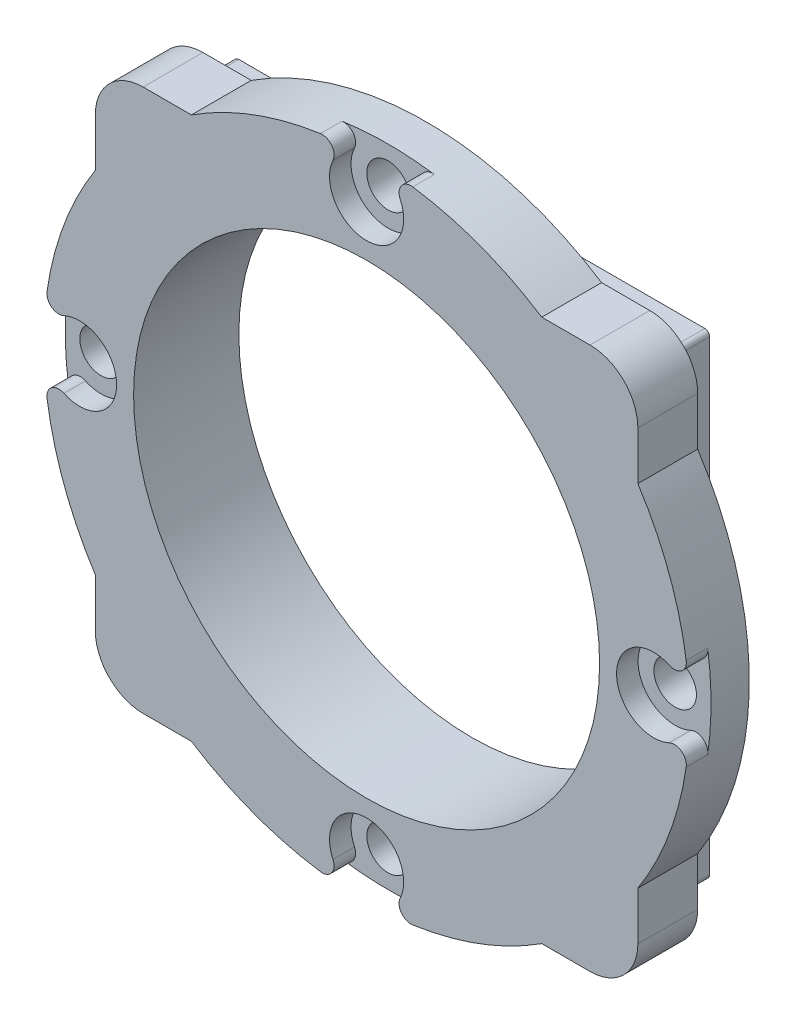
ISO-10303-21;
HEADER;
FILE_DESCRIPTION(('STEP AP214'),'2;1');
FILE_NAME('part.step','',(''),(''),'','','');
FILE_SCHEMA(('AUTOMOTIVE_DESIGN { 1 0 10303 214 1 1 1 1 }'));
ENDSEC;
DATA;
#1=APPLICATION_CONTEXT('core data for automotive mechanical design processes');
#2=APPLICATION_PROTOCOL_DEFINITION('international standard','automotive_design',2000,#1);
#3=PRODUCT_CONTEXT('',#1,'mechanical');
#4=PRODUCT('Part','Part','',(#3));
#5=PRODUCT_RELATED_PRODUCT_CATEGORY('part','',(#4));
#6=PRODUCT_DEFINITION_FORMATION('','',#4);
#7=PRODUCT_DEFINITION_CONTEXT('part definition',#1,'design');
#8=PRODUCT_DEFINITION('design','',#6,#7);
#9=PRODUCT_DEFINITION_SHAPE('','',#8);
#10=(LENGTH_UNIT() NAMED_UNIT(*) SI_UNIT(.MILLI.,.METRE.));
#11=(NAMED_UNIT(*) PLANE_ANGLE_UNIT() SI_UNIT($,.RADIAN.));
#12=(NAMED_UNIT(*) SI_UNIT($,.STERADIAN.) SOLID_ANGLE_UNIT());
#13=UNCERTAINTY_MEASURE_WITH_UNIT(LENGTH_MEASURE(1.E-05),#10,'distance_accuracy_value','');
#14=(GEOMETRIC_REPRESENTATION_CONTEXT(3) GLOBAL_UNCERTAINTY_ASSIGNED_CONTEXT((#13)) GLOBAL_UNIT_ASSIGNED_CONTEXT((#10,
#11,#12)) REPRESENTATION_CONTEXT('',''));
#15=CARTESIAN_POINT('',(0.,0.,0.));
#16=DIRECTION('',(0.,0.,1.));
#17=DIRECTION('',(1.,0.,0.));
#18=AXIS2_PLACEMENT_3D('',#15,#16,#17);
#19=CARTESIAN_POINT('',(-15.24,0.,50.1373319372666));
#20=DIRECTION('',(0.,0.,1.));
#21=DIRECTION('',(1.,0.,0.));
#22=AXIS2_PLACEMENT_3D('',#19,#20,#21);
#23=CYLINDRICAL_SURFACE('',#22,1.1303);
#24=CARTESIAN_POINT('',(-15.24,0.,46.9623319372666));
#25=DIRECTION('',(0.,0.,1.));
#26=DIRECTION('',(1.,0.,0.));
#27=AXIS2_PLACEMENT_3D('',#24,#25,#26);
#28=CIRCLE('',#27,1.1303);
#29=CARTESIAN_POINT('',(-14.1097,0.,46.9623319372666));
#30=VERTEX_POINT('',#29);
#31=EDGE_CURVE('E377',#30,#30,#28,.T.);
#32=ORIENTED_EDGE('',*,*,#31,.F.);
#33=EDGE_LOOP('',(#32));
#34=FACE_BOUND('',#33,.T.);
#35=CARTESIAN_POINT('',(-15.24,0.,48.9943319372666));
#36=DIRECTION('',(0.,0.,1.));
#37=DIRECTION('',(1.,0.,0.));
#38=AXIS2_PLACEMENT_3D('',#35,#36,#37);
#39=CIRCLE('',#38,1.1303);
#40=CARTESIAN_POINT('',(-14.1097,0.,48.9943319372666));
#41=VERTEX_POINT('',#40);
#42=EDGE_CURVE('E423',#41,#41,#39,.F.);
#43=ORIENTED_EDGE('',*,*,#42,.F.);
#44=EDGE_LOOP('',(#43));
#45=FACE_BOUND('',#44,.T.);
#46=ADVANCED_FACE('F39',(#34,#45),#23,.F.);
#47=CARTESIAN_POINT('',(0.,-15.24,50.1373319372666));
#48=DIRECTION('',(0.,0.,1.));
#49=DIRECTION('',(1.,0.,0.));
#50=AXIS2_PLACEMENT_3D('',#47,#48,#49);
#51=CYLINDRICAL_SURFACE('',#50,1.1303);
#52=CARTESIAN_POINT('',(0.,-15.24,46.9623319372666));
#53=DIRECTION('',(0.,0.,1.));
#54=DIRECTION('',(1.,0.,0.));
#55=AXIS2_PLACEMENT_3D('',#52,#53,#54);
#56=CIRCLE('',#55,1.1303);
#57=CARTESIAN_POINT('',(1.1303,-15.24,46.9623319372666));
#58=VERTEX_POINT('',#57);
#59=EDGE_CURVE('E381',#58,#58,#56,.T.);
#60=ORIENTED_EDGE('',*,*,#59,.F.);
#61=EDGE_LOOP('',(#60));
#62=FACE_BOUND('',#61,.T.);
#63=CARTESIAN_POINT('',(0.,-15.24,48.9943319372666));
#64=DIRECTION('',(0.,0.,1.));
#65=DIRECTION('',(1.,0.,0.));
#66=AXIS2_PLACEMENT_3D('',#63,#64,#65);
#67=CIRCLE('',#66,1.1303);
#68=CARTESIAN_POINT('',(1.1303,-15.24,48.9943319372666));
#69=VERTEX_POINT('',#68);
#70=EDGE_CURVE('E419',#69,#69,#67,.F.);
#71=ORIENTED_EDGE('',*,*,#70,.F.);
#72=EDGE_LOOP('',(#71));
#73=FACE_BOUND('',#72,.T.);
#74=ADVANCED_FACE('F647',(#62,#73),#51,.F.);
#75=CARTESIAN_POINT('',(15.24,0.,50.1373319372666));
#76=DIRECTION('',(0.,0.,1.));
#77=DIRECTION('',(1.,0.,0.));
#78=AXIS2_PLACEMENT_3D('',#75,#76,#77);
#79=CYLINDRICAL_SURFACE('',#78,1.1303);
#80=CARTESIAN_POINT('',(15.24,0.,46.9623319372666));
#81=DIRECTION('',(0.,0.,1.));
#82=DIRECTION('',(1.,0.,0.));
#83=AXIS2_PLACEMENT_3D('',#80,#81,#82);
#84=CIRCLE('',#83,1.1303);
#85=CARTESIAN_POINT('',(16.3703,0.,46.9623319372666));
#86=VERTEX_POINT('',#85);
#87=EDGE_CURVE('E384',#86,#86,#84,.T.);
#88=ORIENTED_EDGE('',*,*,#87,.F.);
#89=EDGE_LOOP('',(#88));
#90=FACE_BOUND('',#89,.T.);
#91=CARTESIAN_POINT('',(15.24,0.,48.9943319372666));
#92=DIRECTION('',(0.,0.,1.));
#93=DIRECTION('',(1.,0.,0.));
#94=AXIS2_PLACEMENT_3D('',#91,#92,#93);
#95=CIRCLE('',#94,1.1303);
#96=CARTESIAN_POINT('',(16.3703,0.,48.9943319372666));
#97=VERTEX_POINT('',#96);
#98=EDGE_CURVE('E414',#97,#97,#95,.F.);
#99=ORIENTED_EDGE('',*,*,#98,.F.);
#100=EDGE_LOOP('',(#99));
#101=FACE_BOUND('',#100,.T.);
#102=ADVANCED_FACE('F653',(#90,#101),#79,.F.);
#103=CARTESIAN_POINT('',(0.,15.24,50.1373319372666));
#104=DIRECTION('',(0.,0.,1.));
#105=DIRECTION('',(1.,0.,0.));
#106=AXIS2_PLACEMENT_3D('',#103,#104,#105);
#107=CYLINDRICAL_SURFACE('',#106,1.1303);
#108=CARTESIAN_POINT('',(0.,15.24,46.9623319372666));
#109=DIRECTION('',(0.,0.,1.));
#110=DIRECTION('',(1.,0.,0.));
#111=AXIS2_PLACEMENT_3D('',#108,#109,#110);
#112=CIRCLE('',#111,1.1303);
#113=CARTESIAN_POINT('',(1.1303,15.24,46.9623319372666));
#114=VERTEX_POINT('',#113);
#115=EDGE_CURVE('E387',#114,#114,#112,.T.);
#116=ORIENTED_EDGE('',*,*,#115,.F.);
#117=EDGE_LOOP('',(#116));
#118=FACE_BOUND('',#117,.T.);
#119=CARTESIAN_POINT('',(0.,15.24,48.9943319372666));
#120=DIRECTION('',(0.,0.,1.));
#121=DIRECTION('',(1.,0.,0.));
#122=AXIS2_PLACEMENT_3D('',#119,#120,#121);
#123=CIRCLE('',#122,1.1303);
#124=CARTESIAN_POINT('',(1.1303,15.24,48.9943319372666));
#125=VERTEX_POINT('',#124);
#126=EDGE_CURVE('E391',#125,#125,#123,.F.);
#127=ORIENTED_EDGE('',*,*,#126,.F.);
#128=EDGE_LOOP('',(#127));
#129=FACE_BOUND('',#128,.T.);
#130=ADVANCED_FACE('F732',(#118,#129),#107,.F.);
#131=CARTESIAN_POINT('',(0.,0.,50.8));
#132=DIRECTION('',(0.,0.,-1.));
#133=DIRECTION('',(-1.,0.,0.));
#134=AXIS2_PLACEMENT_3D('',#131,#132,#133);
#135=CYLINDRICAL_SURFACE('',#134,17.145);
#136=CARTESIAN_POINT('',(0.,0.,48.9943319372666));
#137=DIRECTION('',(0.,0.,1.));
#138=DIRECTION('',(1.,0.,0.));
#139=AXIS2_PLACEMENT_3D('',#136,#137,#138);
#140=CIRCLE('',#139,17.145);
#141=CARTESIAN_POINT('',(-16.9690164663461,2.45020512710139,48.9943319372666));
#142=VERTEX_POINT('',#141);
#143=CARTESIAN_POINT('',(-16.9690164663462,-2.45020512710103,48.9943319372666));
#144=VERTEX_POINT('',#143);
#145=EDGE_CURVE('E426',#142,#144,#140,.T.);
#146=ORIENTED_EDGE('',*,*,#145,.F.);
#147=DIRECTION('',(0.,0.,-1.));
#148=VECTOR('',#147,1.);
#149=CARTESIAN_POINT('',(-16.9690164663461,2.45020512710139,50.8));
#150=LINE('',#149,#148);
#151=CARTESIAN_POINT('',(-16.9690164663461,2.45020512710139,50.1373319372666));
#152=VERTEX_POINT('',#151);
#153=EDGE_CURVE('E467',#142,#152,#150,.F.);
#154=ORIENTED_EDGE('',*,*,#153,.T.);
#155=CARTESIAN_POINT('',(0.,0.,50.1373319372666));
#156=DIRECTION('',(0.,0.,1.));
#157=DIRECTION('',(1.,0.,0.));
#158=AXIS2_PLACEMENT_3D('',#155,#156,#157);
#159=CIRCLE('',#158,17.145);
#160=CARTESIAN_POINT('',(-14.403,9.30078577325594,50.1373319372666));
#161=VERTEX_POINT('',#160);
#162=EDGE_CURVE('E488',#161,#152,#159,.T.);
#163=ORIENTED_EDGE('',*,*,#162,.F.);
#164=DIRECTION('',(0.,0.,-1.));
#165=VECTOR('',#164,1.);
#166=CARTESIAN_POINT('',(-14.403,9.30078577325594,50.8));
#167=LINE('',#166,#165);
#168=CARTESIAN_POINT('',(-14.403,9.30078577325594,46.9623319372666));
#169=VERTEX_POINT('',#168);
#170=EDGE_CURVE('E501',#161,#169,#167,.T.);
#171=ORIENTED_EDGE('',*,*,#170,.T.);
#172=CARTESIAN_POINT('',(0.,0.,46.9623319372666));
#173=DIRECTION('',(0.,0.,1.));
#174=DIRECTION('',(1.,0.,0.));
#175=AXIS2_PLACEMENT_3D('',#172,#173,#174);
#176=CIRCLE('',#175,17.145);
#177=CARTESIAN_POINT('',(-14.403,-9.30078577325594,46.9623319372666));
#178=VERTEX_POINT('',#177);
#179=EDGE_CURVE('E318',#169,#178,#176,.T.);
#180=ORIENTED_EDGE('',*,*,#179,.T.);
#181=DIRECTION('',(0.,0.,-1.));
#182=VECTOR('',#181,1.);
#183=CARTESIAN_POINT('',(-14.403,-9.30078577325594,50.8));
#184=LINE('',#183,#182);
#185=CARTESIAN_POINT('',(-14.403,-9.30078577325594,50.1373319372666));
#186=VERTEX_POINT('',#185);
#187=EDGE_CURVE('E622',#178,#186,#184,.F.);
#188=ORIENTED_EDGE('',*,*,#187,.T.);
#189=CARTESIAN_POINT('',(-16.9690164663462,-2.45020512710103,50.1373319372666));
#190=VERTEX_POINT('',#189);
#191=EDGE_CURVE('E496',#190,#186,#159,.T.);
#192=ORIENTED_EDGE('',*,*,#191,.F.);
#193=DIRECTION('',(0.,0.,-1.));
#194=VECTOR('',#193,1.);
#195=CARTESIAN_POINT('',(-16.9690164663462,-2.45020512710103,50.8));
#196=LINE('',#195,#194);
#197=EDGE_CURVE('E464',#190,#144,#196,.T.);
#198=ORIENTED_EDGE('',*,*,#197,.T.);
#199=EDGE_LOOP('',(#146,#154,#163,#171,#180,#188,#192,#198));
#200=FACE_BOUND('',#199,.T.);
#201=ADVANCED_FACE('F486',(#200),#135,.T.);
#202=CARTESIAN_POINT('',(0.,0.,48.9943319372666));
#203=DIRECTION('',(0.,0.,1.));
#204=DIRECTION('',(1.,0.,0.));
#205=AXIS2_PLACEMENT_3D('',#202,#203,#204);
#206=CIRCLE('',#205,17.145);
#207=CARTESIAN_POINT('',(-2.45020512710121,-16.9690164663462,48.9943319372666));
#208=VERTEX_POINT('',#207);
#209=CARTESIAN_POINT('',(2.45020512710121,-16.9690164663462,48.9943319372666));
#210=VERTEX_POINT('',#209);
#211=EDGE_CURVE('E422',#208,#210,#206,.T.);
#212=ORIENTED_EDGE('',*,*,#211,.F.);
#213=DIRECTION('',(0.,0.,-1.));
#214=VECTOR('',#213,1.);
#215=CARTESIAN_POINT('',(-2.45020512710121,-16.9690164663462,50.8));
#216=LINE('',#215,#214);
#217=CARTESIAN_POINT('',(-2.45020512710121,-16.9690164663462,50.1373319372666));
#218=VERTEX_POINT('',#217);
#219=EDGE_CURVE('E448',#208,#218,#216,.F.);
#220=ORIENTED_EDGE('',*,*,#219,.T.);
#221=CARTESIAN_POINT('',(-9.30078577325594,-14.403,50.1373319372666));
#222=VERTEX_POINT('',#221);
#223=EDGE_CURVE('E499',#222,#218,#159,.T.);
#224=ORIENTED_EDGE('',*,*,#223,.F.);
#225=DIRECTION('',(0.,0.,-1.));
#226=VECTOR('',#225,1.);
#227=CARTESIAN_POINT('',(-9.30078577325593,-14.403,50.8));
#228=LINE('',#227,#226);
#229=CARTESIAN_POINT('',(-9.30078577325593,-14.403,46.9623319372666));
#230=VERTEX_POINT('',#229);
#231=EDGE_CURVE('E518',#222,#230,#228,.T.);
#232=ORIENTED_EDGE('',*,*,#231,.T.);
#233=CARTESIAN_POINT('',(9.30078577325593,-14.403,46.9623319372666));
#234=VERTEX_POINT('',#233);
#235=EDGE_CURVE('E567',#230,#234,#176,.T.);
#236=ORIENTED_EDGE('',*,*,#235,.T.);
#237=DIRECTION('',(0.,0.,-1.));
#238=VECTOR('',#237,1.);
#239=CARTESIAN_POINT('',(9.30078577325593,-14.403,50.8));
#240=LINE('',#239,#238);
#241=CARTESIAN_POINT('',(9.30078577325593,-14.403,50.1373319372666));
#242=VERTEX_POINT('',#241);
#243=EDGE_CURVE('E618',#234,#242,#240,.F.);
#244=ORIENTED_EDGE('',*,*,#243,.T.);
#245=CARTESIAN_POINT('',(2.45020512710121,-16.9690164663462,50.1373319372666));
#246=VERTEX_POINT('',#245);
#247=EDGE_CURVE('E495',#246,#242,#159,.T.);
#248=ORIENTED_EDGE('',*,*,#247,.F.);
#249=DIRECTION('',(0.,0.,-1.));
#250=VECTOR('',#249,1.);
#251=CARTESIAN_POINT('',(2.45020512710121,-16.9690164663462,50.8));
#252=LINE('',#251,#250);
#253=EDGE_CURVE('E445',#246,#210,#252,.T.);
#254=ORIENTED_EDGE('',*,*,#253,.T.);
#255=EDGE_LOOP('',(#212,#220,#224,#232,#236,#244,#248,#254));
#256=FACE_BOUND('',#255,.T.);
#257=ADVANCED_FACE('F516',(#256),#135,.T.);
#258=CARTESIAN_POINT('',(-14.403,14.403,16.505494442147));
#259=DIRECTION('',(0.,1.,0.));
#260=DIRECTION('',(0.,0.,1.));
#261=AXIS2_PLACEMENT_3D('',#258,#259,#260);
#262=PLANE('',#261);
#263=DIRECTION('',(1.,0.,0.));
#264=VECTOR('',#263,1.);
#265=CARTESIAN_POINT('',(-14.403,14.403,46.9623319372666));
#266=LINE('',#265,#264);
#267=CARTESIAN_POINT('',(9.30078577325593,14.403,46.9623319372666));
#268=VERTEX_POINT('',#267);
#269=CARTESIAN_POINT('',(11.863,14.403,46.9623319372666));
#270=VERTEX_POINT('',#269);
#271=EDGE_CURVE('E571',#268,#270,#266,.T.);
#272=ORIENTED_EDGE('',*,*,#271,.F.);
#273=DIRECTION('',(0.,0.,-1.));
#274=VECTOR('',#273,1.);
#275=CARTESIAN_POINT('',(9.30078577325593,14.403,50.8));
#276=LINE('',#275,#274);
#277=CARTESIAN_POINT('',(9.30078577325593,14.403,50.1373319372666));
#278=VERTEX_POINT('',#277);
#279=EDGE_CURVE('E335',#278,#268,#276,.T.);
#280=ORIENTED_EDGE('',*,*,#279,.F.);
#281=DIRECTION('',(-1.,0.,0.));
#282=VECTOR('',#281,1.);
#283=CARTESIAN_POINT('',(-14.403,14.403,50.1373319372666));
#284=LINE('',#283,#282);
#285=CARTESIAN_POINT('',(11.863,14.403,50.1373319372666));
#286=VERTEX_POINT('',#285);
#287=EDGE_CURVE('E605',#286,#278,#284,.T.);
#288=ORIENTED_EDGE('',*,*,#287,.F.);
#289=DIRECTION('',(0.,0.,1.));
#290=VECTOR('',#289,1.);
#291=CARTESIAN_POINT('',(11.863,14.403,16.505494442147));
#292=LINE('',#291,#290);
#293=EDGE_CURVE('E323',#286,#270,#292,.F.);
#294=ORIENTED_EDGE('',*,*,#293,.T.);
#295=EDGE_LOOP('',(#272,#280,#288,#294));
#296=FACE_BOUND('',#295,.T.);
#297=ADVANCED_FACE('F800',(#296),#262,.T.);
#298=CARTESIAN_POINT('',(0.,0.,50.1373319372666));
#299=DIRECTION('',(0.,0.,1.));
#300=DIRECTION('',(1.,0.,0.));
#301=AXIS2_PLACEMENT_3D('',#298,#299,#300);
#302=PLANE('',#301);
#303=CARTESIAN_POINT('',(0.,0.,50.1373319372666));
#304=DIRECTION('',(0.,0.,1.));
#305=DIRECTION('',(1.,0.,0.));
#306=AXIS2_PLACEMENT_3D('',#303,#304,#305);
#307=CIRCLE('',#306,12.371);
#308=CARTESIAN_POINT('',(12.371,0.,50.1373319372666));
#309=VERTEX_POINT('',#308);
#310=EDGE_CURVE('E1244',#309,#309,#307,.T.);
#311=ORIENTED_EDGE('',*,*,#310,.F.);
#312=EDGE_LOOP('',(#311));
#313=FACE_BOUND('',#312,.T.);
#314=ORIENTED_EDGE('',*,*,#162,.T.);
#315=CARTESIAN_POINT('',(-16.340534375,2.3594567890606,50.1373319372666));
#316=DIRECTION('',(0.,0.,1.));
#317=DIRECTION('',(1.,0.,0.));
#318=AXIS2_PLACEMENT_3D('',#315,#316,#317);
#319=CIRCLE('',#318,0.635);
#320=CARTESIAN_POINT('',(-16.0721113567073,1.7839795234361,50.1373319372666));
#321=VERTEX_POINT('',#320);
#322=EDGE_CURVE('E472',#152,#321,#319,.T.);
#323=ORIENTED_EDGE('',*,*,#322,.T.);
#324=CARTESIAN_POINT('',(-15.24,1.59630526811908E-13,50.1373319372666));
#325=DIRECTION('',(0.,0.,1.));
#326=DIRECTION('',(0.,1.,0.));
#327=AXIS2_PLACEMENT_3D('',#324,#325,#326);
#328=CIRCLE('',#327,1.9685);
#329=CARTESIAN_POINT('',(-16.0721113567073,-1.78397952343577,50.1373319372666));
#330=VERTEX_POINT('',#329);
#331=EDGE_CURVE('E542',#330,#321,#328,.T.);
#332=ORIENTED_EDGE('',*,*,#331,.F.);
#333=CARTESIAN_POINT('',(-16.340534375,-2.35945678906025,50.1373319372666));
#334=DIRECTION('',(0.,0.,1.));
#335=DIRECTION('',(1.,0.,0.));
#336=AXIS2_PLACEMENT_3D('',#333,#334,#335);
#337=CIRCLE('',#336,0.635);
#338=EDGE_CURVE('E470',#330,#190,#337,.T.);
#339=ORIENTED_EDGE('',*,*,#338,.T.);
#340=ORIENTED_EDGE('',*,*,#191,.T.);
#341=DIRECTION('',(0.,-1.,0.));
#342=VECTOR('',#341,1.);
#343=CARTESIAN_POINT('',(-14.403,14.403,50.1373319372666));
#344=LINE('',#343,#342);
#345=CARTESIAN_POINT('',(-14.403,-11.863,50.1373319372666));
#346=VERTEX_POINT('',#345);
#347=EDGE_CURVE('E608',#186,#346,#344,.T.);
#348=ORIENTED_EDGE('',*,*,#347,.T.);
#349=CARTESIAN_POINT('',(-11.863,-11.863,50.1373319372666));
#350=DIRECTION('',(0.,0.,1.));
#351=DIRECTION('',(1.,0.,0.));
#352=AXIS2_PLACEMENT_3D('',#349,#350,#351);
#353=CIRCLE('',#352,2.54);
#354=CARTESIAN_POINT('',(-11.863,-14.403,50.1373319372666));
#355=VERTEX_POINT('',#354);
#356=EDGE_CURVE('E700',#346,#355,#353,.T.);
#357=ORIENTED_EDGE('',*,*,#356,.T.);
#358=DIRECTION('',(1.,0.,0.));
#359=VECTOR('',#358,1.);
#360=CARTESIAN_POINT('',(-14.403,-14.403,50.1373319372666));
#361=LINE('',#360,#359);
#362=EDGE_CURVE('E512',#355,#222,#361,.T.);
#363=ORIENTED_EDGE('',*,*,#362,.T.);
#364=ORIENTED_EDGE('',*,*,#223,.T.);
#365=CARTESIAN_POINT('',(-2.35945678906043,-16.340534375,50.1373319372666));
#366=DIRECTION('',(0.,0.,1.));
#367=DIRECTION('',(1.,0.,0.));
#368=AXIS2_PLACEMENT_3D('',#365,#366,#367);
#369=CIRCLE('',#368,0.635);
#370=CARTESIAN_POINT('',(-1.78397952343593,-16.0721113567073,50.1373319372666));
#371=VERTEX_POINT('',#370);
#372=EDGE_CURVE('E453',#218,#371,#369,.T.);
#373=ORIENTED_EDGE('',*,*,#372,.T.);
#374=CARTESIAN_POINT('',(0.,-15.24,50.1373319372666));
#375=DIRECTION('',(0.,0.,1.));
#376=DIRECTION('',(-1.,0.,0.));
#377=AXIS2_PLACEMENT_3D('',#374,#375,#376);
#378=CIRCLE('',#377,1.9685);
#379=CARTESIAN_POINT('',(1.78397952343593,-16.0721113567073,50.1373319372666));
#380=VERTEX_POINT('',#379);
#381=EDGE_CURVE('E530',#380,#371,#378,.T.);
#382=ORIENTED_EDGE('',*,*,#381,.F.);
#383=CARTESIAN_POINT('',(2.35945678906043,-16.340534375,50.1373319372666));
#384=DIRECTION('',(0.,0.,1.));
#385=DIRECTION('',(1.,0.,0.));
#386=AXIS2_PLACEMENT_3D('',#383,#384,#385);
#387=CIRCLE('',#386,0.635);
#388=EDGE_CURVE('E451',#380,#246,#387,.T.);
#389=ORIENTED_EDGE('',*,*,#388,.T.);
#390=ORIENTED_EDGE('',*,*,#247,.T.);
#391=CARTESIAN_POINT('',(11.863,-14.403,50.1373319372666));
#392=VERTEX_POINT('',#391);
#393=EDGE_CURVE('E610',#242,#392,#361,.T.);
#394=ORIENTED_EDGE('',*,*,#393,.T.);
#395=CARTESIAN_POINT('',(11.863,-11.863,50.1373319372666));
#396=DIRECTION('',(0.,0.,1.));
#397=DIRECTION('',(1.,0.,0.));
#398=AXIS2_PLACEMENT_3D('',#395,#396,#397);
#399=CIRCLE('',#398,2.54);
#400=CARTESIAN_POINT('',(14.403,-11.863,50.1373319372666));
#401=VERTEX_POINT('',#400);
#402=EDGE_CURVE('E780',#392,#401,#399,.T.);
#403=ORIENTED_EDGE('',*,*,#402,.T.);
#404=DIRECTION('',(0.,1.,0.));
#405=VECTOR('',#404,1.);
#406=CARTESIAN_POINT('',(14.403,14.403,50.1373319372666));
#407=LINE('',#406,#405);
#408=CARTESIAN_POINT('',(14.403,-9.30078577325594,50.1373319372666));
#409=VERTEX_POINT('',#408);
#410=EDGE_CURVE('E602',#401,#409,#407,.T.);
#411=ORIENTED_EDGE('',*,*,#410,.T.);
#412=CARTESIAN_POINT('',(16.9690164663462,-2.45020512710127,50.1373319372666));
#413=VERTEX_POINT('',#412);
#414=EDGE_CURVE('E498',#409,#413,#159,.T.);
#415=ORIENTED_EDGE('',*,*,#414,.T.);
#416=CARTESIAN_POINT('',(16.340534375,-2.35945678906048,50.1373319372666));
#417=DIRECTION('',(0.,0.,1.));
#418=DIRECTION('',(1.,0.,0.));
#419=AXIS2_PLACEMENT_3D('',#416,#417,#418);
#420=CIRCLE('',#419,0.635);
#421=CARTESIAN_POINT('',(16.0721113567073,-1.78397952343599,50.1373319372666));
#422=VERTEX_POINT('',#421);
#423=EDGE_CURVE('E434',#413,#422,#420,.T.);
#424=ORIENTED_EDGE('',*,*,#423,.T.);
#425=CARTESIAN_POINT('',(15.24,0.,50.1373319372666));
#426=DIRECTION('',(0.,0.,1.));
#427=DIRECTION('',(0.,-1.,0.));
#428=AXIS2_PLACEMENT_3D('',#425,#426,#427);
#429=CIRCLE('',#428,1.9685);
#430=CARTESIAN_POINT('',(16.0721113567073,1.78397952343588,50.1373319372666));
#431=VERTEX_POINT('',#430);
#432=EDGE_CURVE('E534',#431,#422,#429,.T.);
#433=ORIENTED_EDGE('',*,*,#432,.F.);
#434=CARTESIAN_POINT('',(16.340534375,2.35945678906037,50.1373319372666));
#435=DIRECTION('',(0.,0.,1.));
#436=DIRECTION('',(1.,0.,0.));
#437=AXIS2_PLACEMENT_3D('',#434,#435,#436);
#438=CIRCLE('',#437,0.635);
#439=CARTESIAN_POINT('',(16.9690164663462,2.45020512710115,50.1373319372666));
#440=VERTEX_POINT('',#439);
#441=EDGE_CURVE('E432',#431,#440,#438,.T.);
#442=ORIENTED_EDGE('',*,*,#441,.T.);
#443=CARTESIAN_POINT('',(14.403,9.30078577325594,50.1373319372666));
#444=VERTEX_POINT('',#443);
#445=EDGE_CURVE('E500',#440,#444,#159,.T.);
#446=ORIENTED_EDGE('',*,*,#445,.T.);
#447=CARTESIAN_POINT('',(14.403,11.863,50.1373319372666));
#448=VERTEX_POINT('',#447);
#449=EDGE_CURVE('E601',#444,#448,#407,.T.);
#450=ORIENTED_EDGE('',*,*,#449,.T.);
#451=CARTESIAN_POINT('',(11.863,11.863,50.1373319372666));
#452=DIRECTION('',(0.,0.,1.));
#453=DIRECTION('',(1.,0.,0.));
#454=AXIS2_PLACEMENT_3D('',#451,#452,#453);
#455=CIRCLE('',#454,2.54);
#456=EDGE_CURVE('E788',#448,#286,#455,.T.);
#457=ORIENTED_EDGE('',*,*,#456,.T.);
#458=ORIENTED_EDGE('',*,*,#287,.T.);
#459=CARTESIAN_POINT('',(0.,0.,50.1373319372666));
#460=DIRECTION('',(0.,0.,1.));
#461=DIRECTION('',(1.,0.,0.));
#462=AXIS2_PLACEMENT_3D('',#459,#460,#461);
#463=CIRCLE('',#462,17.145);
#464=CARTESIAN_POINT('',(2.45020512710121,16.9690164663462,50.1373319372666));
#465=VERTEX_POINT('',#464);
#466=EDGE_CURVE('E307',#278,#465,#463,.T.);
#467=ORIENTED_EDGE('',*,*,#466,.T.);
#468=CARTESIAN_POINT('',(2.35945678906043,16.340534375,50.1373319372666));
#469=DIRECTION('',(0.,0.,1.));
#470=DIRECTION('',(1.,0.,0.));
#471=AXIS2_PLACEMENT_3D('',#468,#469,#470);
#472=CIRCLE('',#471,0.635);
#473=CARTESIAN_POINT('',(1.78397952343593,16.0721113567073,50.1373319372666));
#474=VERTEX_POINT('',#473);
#475=EDGE_CURVE('E402',#465,#474,#472,.T.);
#476=ORIENTED_EDGE('',*,*,#475,.T.);
#477=CARTESIAN_POINT('',(0.,15.24,50.1373319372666));
#478=DIRECTION('',(0.,0.,1.));
#479=DIRECTION('',(1.,0.,0.));
#480=AXIS2_PLACEMENT_3D('',#477,#478,#479);
#481=CIRCLE('',#480,1.9685);
#482=CARTESIAN_POINT('',(-1.78397952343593,16.0721113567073,50.1373319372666));
#483=VERTEX_POINT('',#482);
#484=EDGE_CURVE('E548',#483,#474,#481,.T.);
#485=ORIENTED_EDGE('',*,*,#484,.F.);
#486=CARTESIAN_POINT('',(-2.35945678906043,16.340534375,50.1373319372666));
#487=DIRECTION('',(0.,0.,1.));
#488=DIRECTION('',(1.,0.,0.));
#489=AXIS2_PLACEMENT_3D('',#486,#487,#488);
#490=CIRCLE('',#489,0.635);
#491=CARTESIAN_POINT('',(-2.45020512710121,16.9690164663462,50.1373319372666));
#492=VERTEX_POINT('',#491);
#493=EDGE_CURVE('E400',#483,#492,#490,.T.);
#494=ORIENTED_EDGE('',*,*,#493,.T.);
#495=CARTESIAN_POINT('',(-9.30078577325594,14.403,50.1373319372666));
#496=VERTEX_POINT('',#495);
#497=EDGE_CURVE('E338',#492,#496,#463,.T.);
#498=ORIENTED_EDGE('',*,*,#497,.T.);
#499=CARTESIAN_POINT('',(-11.863,14.403,50.1373319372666));
#500=VERTEX_POINT('',#499);
#501=EDGE_CURVE('E604',#496,#500,#284,.T.);
#502=ORIENTED_EDGE('',*,*,#501,.T.);
#503=CARTESIAN_POINT('',(-11.863,11.863,50.1373319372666));
#504=DIRECTION('',(0.,0.,1.));
#505=DIRECTION('',(1.,0.,0.));
#506=AXIS2_PLACEMENT_3D('',#503,#504,#505);
#507=CIRCLE('',#506,2.54);
#508=CARTESIAN_POINT('',(-14.403,11.863,50.1373319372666));
#509=VERTEX_POINT('',#508);
#510=EDGE_CURVE('E322',#500,#509,#507,.T.);
#511=ORIENTED_EDGE('',*,*,#510,.T.);
#512=EDGE_CURVE('E493',#509,#161,#344,.T.);
#513=ORIENTED_EDGE('',*,*,#512,.T.);
#514=EDGE_LOOP('',(#314,#323,#332,#339,#340,#348,#357,#363,#364,#373,#382,#389,#390,#394,#403,
#411,#415,#424,#433,#442,#446,#450,#457,#458,#467,#476,#485,#494,#498,#502,#511,#513));
#515=FACE_BOUND('',#514,.T.);
#516=ADVANCED_FACE('F490',(#313,#515),#302,.T.);
#517=CARTESIAN_POINT('',(0.,0.,50.8));
#518=DIRECTION('',(0.,0.,-1.));
#519=DIRECTION('',(-1.,0.,0.));
#520=AXIS2_PLACEMENT_3D('',#517,#518,#519);
#521=CYLINDRICAL_SURFACE('',#520,17.145);
#522=CARTESIAN_POINT('',(0.,0.,48.9943319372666));
#523=DIRECTION('',(0.,0.,1.));
#524=DIRECTION('',(1.,0.,0.));
#525=AXIS2_PLACEMENT_3D('',#522,#523,#524);
#526=CIRCLE('',#525,17.145);
#527=CARTESIAN_POINT('',(2.45020512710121,16.9690164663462,48.9943319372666));
#528=VERTEX_POINT('',#527);
#529=CARTESIAN_POINT('',(-2.45020512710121,16.9690164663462,48.9943319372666));
#530=VERTEX_POINT('',#529);
#531=EDGE_CURVE('E390',#528,#530,#526,.T.);
#532=ORIENTED_EDGE('',*,*,#531,.F.);
#533=DIRECTION('',(0.,0.,-1.));
#534=VECTOR('',#533,1.);
#535=CARTESIAN_POINT('',(2.45020512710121,16.9690164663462,50.8));
#536=LINE('',#535,#534);
#537=EDGE_CURVE('E397',#528,#465,#536,.F.);
#538=ORIENTED_EDGE('',*,*,#537,.T.);
#539=ORIENTED_EDGE('',*,*,#466,.F.);
#540=ORIENTED_EDGE('',*,*,#279,.T.);
#541=CARTESIAN_POINT('',(0.,0.,46.9623319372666));
#542=DIRECTION('',(0.,0.,1.));
#543=DIRECTION('',(1.,0.,0.));
#544=AXIS2_PLACEMENT_3D('',#541,#542,#543);
#545=CIRCLE('',#544,17.145);
#546=CARTESIAN_POINT('',(-9.30078577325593,14.403,46.9623319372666));
#547=VERTEX_POINT('',#546);
#548=EDGE_CURVE('E317',#268,#547,#545,.T.);
#549=ORIENTED_EDGE('',*,*,#548,.T.);
#550=DIRECTION('',(0.,0.,-1.));
#551=VECTOR('',#550,1.);
#552=CARTESIAN_POINT('',(-9.30078577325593,14.403,50.8));
#553=LINE('',#552,#551);
#554=EDGE_CURVE('E316',#547,#496,#553,.F.);
#555=ORIENTED_EDGE('',*,*,#554,.T.);
#556=ORIENTED_EDGE('',*,*,#497,.F.);
#557=DIRECTION('',(0.,0.,-1.));
#558=VECTOR('',#557,1.);
#559=CARTESIAN_POINT('',(-2.45020512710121,16.9690164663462,50.8));
#560=LINE('',#559,#558);
#561=EDGE_CURVE('E376',#492,#530,#560,.T.);
#562=ORIENTED_EDGE('',*,*,#561,.T.);
#563=EDGE_LOOP('',(#532,#538,#539,#540,#549,#555,#556,#562));
#564=FACE_BOUND('',#563,.T.);
#565=ADVANCED_FACE('F795',(#564),#521,.T.);
#566=DIRECTION('',(1.,0.,0.));
#567=VECTOR('',#566,1.);
#568=CARTESIAN_POINT('',(-14.403,14.403,46.9623319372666));
#569=LINE('',#568,#567);
#570=CARTESIAN_POINT('',(-11.863,14.403,46.9623319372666));
#571=VERTEX_POINT('',#570);
#572=EDGE_CURVE('E298',#571,#547,#569,.T.);
#573=ORIENTED_EDGE('',*,*,#572,.F.);
#574=DIRECTION('',(0.,0.,1.));
#575=VECTOR('',#574,1.);
#576=CARTESIAN_POINT('',(-11.863,14.403,16.505494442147));
#577=LINE('',#576,#575);
#578=EDGE_CURVE('E313',#571,#500,#577,.T.);
#579=ORIENTED_EDGE('',*,*,#578,.T.);
#580=ORIENTED_EDGE('',*,*,#501,.F.);
#581=ORIENTED_EDGE('',*,*,#554,.F.);
#582=EDGE_LOOP('',(#573,#579,#580,#581));
#583=FACE_BOUND('',#582,.T.);
#584=ADVANCED_FACE('F311',(#583),#262,.T.);
#585=CARTESIAN_POINT('',(0.,0.,48.9943319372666));
#586=DIRECTION('',(0.,0.,1.));
#587=DIRECTION('',(1.,0.,0.));
#588=AXIS2_PLACEMENT_3D('',#585,#586,#587);
#589=CIRCLE('',#588,17.145);
#590=CARTESIAN_POINT('',(16.9690164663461,-2.45020512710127,48.9943319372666));
#591=VERTEX_POINT('',#590);
#592=CARTESIAN_POINT('',(16.9690164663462,2.45020512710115,48.9943319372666));
#593=VERTEX_POINT('',#592);
#594=EDGE_CURVE('E417',#591,#593,#589,.T.);
#595=ORIENTED_EDGE('',*,*,#594,.F.);
#596=DIRECTION('',(0.,0.,-1.));
#597=VECTOR('',#596,1.);
#598=CARTESIAN_POINT('',(16.9690164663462,-2.45020512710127,50.8));
#599=LINE('',#598,#597);
#600=EDGE_CURVE('E429',#591,#413,#599,.F.);
#601=ORIENTED_EDGE('',*,*,#600,.T.);
#602=ORIENTED_EDGE('',*,*,#414,.F.);
#603=DIRECTION('',(0.,0.,-1.));
#604=VECTOR('',#603,1.);
#605=CARTESIAN_POINT('',(14.403,-9.30078577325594,50.8));
#606=LINE('',#605,#604);
#607=CARTESIAN_POINT('',(14.403,-9.30078577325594,46.9623319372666));
#608=VERTEX_POINT('',#607);
#609=EDGE_CURVE('E615',#409,#608,#606,.T.);
#610=ORIENTED_EDGE('',*,*,#609,.T.);
#611=CARTESIAN_POINT('',(14.403,9.30078577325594,46.9623319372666));
#612=VERTEX_POINT('',#611);
#613=EDGE_CURVE('E568',#608,#612,#176,.T.);
#614=ORIENTED_EDGE('',*,*,#613,.T.);
#615=DIRECTION('',(0.,0.,-1.));
#616=VECTOR('',#615,1.);
#617=CARTESIAN_POINT('',(14.403,9.30078577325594,50.8));
#618=LINE('',#617,#616);
#619=EDGE_CURVE('E612',#612,#444,#618,.F.);
#620=ORIENTED_EDGE('',*,*,#619,.T.);
#621=ORIENTED_EDGE('',*,*,#445,.F.);
#622=DIRECTION('',(0.,0.,-1.));
#623=VECTOR('',#622,1.);
#624=CARTESIAN_POINT('',(16.9690164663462,2.45020512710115,50.8));
#625=LINE('',#624,#623);
#626=EDGE_CURVE('E413',#440,#593,#625,.T.);
#627=ORIENTED_EDGE('',*,*,#626,.T.);
#628=EDGE_LOOP('',(#595,#601,#602,#610,#614,#620,#621,#627));
#629=FACE_BOUND('',#628,.T.);
#630=ADVANCED_FACE('F629',(#629),#135,.T.);
#631=CARTESIAN_POINT('',(-14.403,14.403,16.505494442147));
#632=DIRECTION('',(-1.,0.,0.));
#633=DIRECTION('',(0.,0.,1.));
#634=AXIS2_PLACEMENT_3D('',#631,#632,#633);
#635=PLANE('',#634);
#636=DIRECTION('',(0.,1.,0.));
#637=VECTOR('',#636,1.);
#638=CARTESIAN_POINT('',(-14.403,14.403,46.9623319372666));
#639=LINE('',#638,#637);
#640=CARTESIAN_POINT('',(-14.403,11.863,46.9623319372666));
#641=VERTEX_POINT('',#640);
#642=EDGE_CURVE('E301',#169,#641,#639,.T.);
#643=ORIENTED_EDGE('',*,*,#642,.F.);
#644=ORIENTED_EDGE('',*,*,#170,.F.);
#645=ORIENTED_EDGE('',*,*,#512,.F.);
#646=DIRECTION('',(0.,0.,1.));
#647=VECTOR('',#646,1.);
#648=CARTESIAN_POINT('',(-14.403,11.863,16.505494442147));
#649=LINE('',#648,#647);
#650=EDGE_CURVE('E327',#509,#641,#649,.F.);
#651=ORIENTED_EDGE('',*,*,#650,.T.);
#652=EDGE_LOOP('',(#643,#644,#645,#651));
#653=FACE_BOUND('',#652,.T.);
#654=ADVANCED_FACE('F626',(#653),#635,.T.);
#655=CARTESIAN_POINT('',(14.403,14.403,16.505494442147));
#656=DIRECTION('',(1.,0.,0.));
#657=DIRECTION('',(0.,0.,-1.));
#658=AXIS2_PLACEMENT_3D('',#655,#656,#657);
#659=PLANE('',#658);
#660=DIRECTION('',(0.,-1.,0.));
#661=VECTOR('',#660,1.);
#662=CARTESIAN_POINT('',(14.403,14.403,46.9623319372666));
#663=LINE('',#662,#661);
#664=CARTESIAN_POINT('',(14.403,11.863,46.9623319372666));
#665=VERTEX_POINT('',#664);
#666=EDGE_CURVE('E577',#665,#612,#663,.T.);
#667=ORIENTED_EDGE('',*,*,#666,.F.);
#668=DIRECTION('',(0.,0.,1.));
#669=VECTOR('',#668,1.);
#670=CARTESIAN_POINT('',(14.403,11.863,16.505494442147));
#671=LINE('',#670,#669);
#672=EDGE_CURVE('E324',#665,#448,#671,.T.);
#673=ORIENTED_EDGE('',*,*,#672,.T.);
#674=ORIENTED_EDGE('',*,*,#449,.F.);
#675=ORIENTED_EDGE('',*,*,#619,.F.);
#676=EDGE_LOOP('',(#667,#673,#674,#675));
#677=FACE_BOUND('',#676,.T.);
#678=ADVANCED_FACE('F628',(#677),#659,.T.);
#679=DIRECTION('',(0.,1.,0.));
#680=VECTOR('',#679,1.);
#681=CARTESIAN_POINT('',(-14.403,14.403,46.9623319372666));
#682=LINE('',#681,#680);
#683=CARTESIAN_POINT('',(-14.403,-11.863,46.9623319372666));
#684=VERTEX_POINT('',#683);
#685=EDGE_CURVE('E575',#684,#178,#682,.T.);
#686=ORIENTED_EDGE('',*,*,#685,.F.);
#687=DIRECTION('',(0.,0.,1.));
#688=VECTOR('',#687,1.);
#689=CARTESIAN_POINT('',(-14.403,-11.863,16.505494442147));
#690=LINE('',#689,#688);
#691=EDGE_CURVE('E505',#684,#346,#690,.T.);
#692=ORIENTED_EDGE('',*,*,#691,.T.);
#693=ORIENTED_EDGE('',*,*,#347,.F.);
#694=ORIENTED_EDGE('',*,*,#187,.F.);
#695=EDGE_LOOP('',(#686,#692,#693,#694));
#696=FACE_BOUND('',#695,.T.);
#697=ADVANCED_FACE('F631',(#696),#635,.T.);
#698=CARTESIAN_POINT('',(-14.403,-14.403,16.505494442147));
#699=DIRECTION('',(0.,-1.,0.));
#700=DIRECTION('',(0.,0.,-1.));
#701=AXIS2_PLACEMENT_3D('',#698,#699,#700);
#702=PLANE('',#701);
#703=DIRECTION('',(-1.,0.,0.));
#704=VECTOR('',#703,1.);
#705=CARTESIAN_POINT('',(-14.403,-14.403,46.9623319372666));
#706=LINE('',#705,#704);
#707=CARTESIAN_POINT('',(-11.863,-14.403,46.9623319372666));
#708=VERTEX_POINT('',#707);
#709=EDGE_CURVE('E583',#230,#708,#706,.T.);
#710=ORIENTED_EDGE('',*,*,#709,.F.);
#711=ORIENTED_EDGE('',*,*,#231,.F.);
#712=ORIENTED_EDGE('',*,*,#362,.F.);
#713=DIRECTION('',(0.,0.,1.));
#714=VECTOR('',#713,1.);
#715=CARTESIAN_POINT('',(-11.863,-14.403,16.505494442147));
#716=LINE('',#715,#714);
#717=EDGE_CURVE('E693',#355,#708,#716,.F.);
#718=ORIENTED_EDGE('',*,*,#717,.T.);
#719=EDGE_LOOP('',(#710,#711,#712,#718));
#720=FACE_BOUND('',#719,.T.);
#721=ADVANCED_FACE('F644',(#720),#702,.T.);
#722=DIRECTION('',(-1.,0.,0.));
#723=VECTOR('',#722,1.);
#724=CARTESIAN_POINT('',(-14.403,-14.403,46.9623319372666));
#725=LINE('',#724,#723);
#726=CARTESIAN_POINT('',(11.863,-14.403,46.9623319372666));
#727=VERTEX_POINT('',#726);
#728=EDGE_CURVE('E587',#727,#234,#725,.T.);
#729=ORIENTED_EDGE('',*,*,#728,.F.);
#730=DIRECTION('',(0.,0.,1.));
#731=VECTOR('',#730,1.);
#732=CARTESIAN_POINT('',(11.863,-14.403,16.505494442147));
#733=LINE('',#732,#731);
#734=EDGE_CURVE('E779',#727,#392,#733,.T.);
#735=ORIENTED_EDGE('',*,*,#734,.T.);
#736=ORIENTED_EDGE('',*,*,#393,.F.);
#737=ORIENTED_EDGE('',*,*,#243,.F.);
#738=EDGE_LOOP('',(#729,#735,#736,#737));
#739=FACE_BOUND('',#738,.T.);
#740=ADVANCED_FACE('F684',(#739),#702,.T.);
#741=DIRECTION('',(0.,-1.,0.));
#742=VECTOR('',#741,1.);
#743=CARTESIAN_POINT('',(14.403,14.403,46.9623319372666));
#744=LINE('',#743,#742);
#745=CARTESIAN_POINT('',(14.403,-11.863,46.9623319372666));
#746=VERTEX_POINT('',#745);
#747=EDGE_CURVE('E581',#608,#746,#744,.T.);
#748=ORIENTED_EDGE('',*,*,#747,.F.);
#749=ORIENTED_EDGE('',*,*,#609,.F.);
#750=ORIENTED_EDGE('',*,*,#410,.F.);
#751=DIRECTION('',(0.,0.,1.));
#752=VECTOR('',#751,1.);
#753=CARTESIAN_POINT('',(14.403,-11.863,16.505494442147));
#754=LINE('',#753,#752);
#755=EDGE_CURVE('E329',#401,#746,#754,.F.);
#756=ORIENTED_EDGE('',*,*,#755,.T.);
#757=EDGE_LOOP('',(#748,#749,#750,#756));
#758=FACE_BOUND('',#757,.T.);
#759=ADVANCED_FACE('F638',(#758),#659,.T.);
#760=CARTESIAN_POINT('',(-11.863,-11.863,16.505494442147));
#761=DIRECTION('',(0.,0.,1.));
#762=DIRECTION('',(1.,0.,0.));
#763=AXIS2_PLACEMENT_3D('',#760,#761,#762);
#764=CYLINDRICAL_SURFACE('',#763,2.54);
#765=CARTESIAN_POINT('',(-11.863,-11.863,46.9623319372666));
#766=DIRECTION('',(0.,0.,1.));
#767=DIRECTION('',(1.,0.,0.));
#768=AXIS2_PLACEMENT_3D('',#765,#766,#767);
#769=CIRCLE('',#768,2.54);
#770=EDGE_CURVE('E579',#708,#684,#769,.F.);
#771=ORIENTED_EDGE('',*,*,#770,.F.);
#772=ORIENTED_EDGE('',*,*,#717,.F.);
#773=ORIENTED_EDGE('',*,*,#356,.F.);
#774=ORIENTED_EDGE('',*,*,#691,.F.);
#775=EDGE_LOOP('',(#771,#772,#773,#774));
#776=FACE_BOUND('',#775,.T.);
#777=ADVANCED_FACE('F698',(#776),#764,.T.);
#778=CARTESIAN_POINT('',(11.863,-11.863,16.505494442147));
#779=DIRECTION('',(0.,0.,1.));
#780=DIRECTION('',(1.,0.,0.));
#781=AXIS2_PLACEMENT_3D('',#778,#779,#780);
#782=CYLINDRICAL_SURFACE('',#781,2.54);
#783=CARTESIAN_POINT('',(11.863,-11.863,46.9623319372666));
#784=DIRECTION('',(0.,0.,1.));
#785=DIRECTION('',(1.,0.,0.));
#786=AXIS2_PLACEMENT_3D('',#783,#784,#785);
#787=CIRCLE('',#786,2.54);
#788=EDGE_CURVE('E585',#746,#727,#787,.F.);
#789=ORIENTED_EDGE('',*,*,#788,.F.);
#790=ORIENTED_EDGE('',*,*,#755,.F.);
#791=ORIENTED_EDGE('',*,*,#402,.F.);
#792=ORIENTED_EDGE('',*,*,#734,.F.);
#793=EDGE_LOOP('',(#789,#790,#791,#792));
#794=FACE_BOUND('',#793,.T.);
#795=ADVANCED_FACE('F777',(#794),#782,.T.);
#796=CARTESIAN_POINT('',(11.863,11.863,16.505494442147));
#797=DIRECTION('',(0.,0.,1.));
#798=DIRECTION('',(1.,0.,0.));
#799=AXIS2_PLACEMENT_3D('',#796,#797,#798);
#800=CYLINDRICAL_SURFACE('',#799,2.54);
#801=CARTESIAN_POINT('',(11.863,11.863,46.9623319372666));
#802=DIRECTION('',(0.,0.,1.));
#803=DIRECTION('',(1.,0.,0.));
#804=AXIS2_PLACEMENT_3D('',#801,#802,#803);
#805=CIRCLE('',#804,2.54);
#806=EDGE_CURVE('E573',#270,#665,#805,.F.);
#807=ORIENTED_EDGE('',*,*,#806,.F.);
#808=ORIENTED_EDGE('',*,*,#293,.F.);
#809=ORIENTED_EDGE('',*,*,#456,.F.);
#810=ORIENTED_EDGE('',*,*,#672,.F.);
#811=EDGE_LOOP('',(#807,#808,#809,#810));
#812=FACE_BOUND('',#811,.T.);
#813=ADVANCED_FACE('F805',(#812),#800,.T.);
#814=CARTESIAN_POINT('',(-11.863,11.863,16.505494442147));
#815=DIRECTION('',(0.,0.,1.));
#816=DIRECTION('',(1.,0.,0.));
#817=AXIS2_PLACEMENT_3D('',#814,#815,#816);
#818=CYLINDRICAL_SURFACE('',#817,2.54);
#819=CARTESIAN_POINT('',(-11.863,11.863,46.9623319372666));
#820=DIRECTION('',(0.,0.,1.));
#821=DIRECTION('',(1.,0.,0.));
#822=AXIS2_PLACEMENT_3D('',#819,#820,#821);
#823=CIRCLE('',#822,2.54);
#824=EDGE_CURVE('E294',#641,#571,#823,.F.);
#825=ORIENTED_EDGE('',*,*,#824,.F.);
#826=ORIENTED_EDGE('',*,*,#650,.F.);
#827=ORIENTED_EDGE('',*,*,#510,.F.);
#828=ORIENTED_EDGE('',*,*,#578,.F.);
#829=EDGE_LOOP('',(#825,#826,#827,#828));
#830=FACE_BOUND('',#829,.T.);
#831=ADVANCED_FACE('F321',(#830),#818,.T.);
#832=CARTESIAN_POINT('',(0.,0.,46.9623319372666));
#833=DIRECTION('',(0.,0.,1.));
#834=DIRECTION('',(1.,0.,0.));
#835=AXIS2_PLACEMENT_3D('',#832,#833,#834);
#836=PLANE('',#835);
#837=ORIENTED_EDGE('',*,*,#115,.T.);
#838=EDGE_LOOP('',(#837));
#839=FACE_BOUND('',#838,.T.);
#840=ORIENTED_EDGE('',*,*,#87,.T.);
#841=EDGE_LOOP('',(#840));
#842=FACE_BOUND('',#841,.T.);
#843=ORIENTED_EDGE('',*,*,#59,.T.);
#844=EDGE_LOOP('',(#843));
#845=FACE_BOUND('',#844,.T.);
#846=ORIENTED_EDGE('',*,*,#31,.T.);
#847=EDGE_LOOP('',(#846));
#848=FACE_BOUND('',#847,.T.);
#849=ORIENTED_EDGE('',*,*,#728,.T.);
#850=ORIENTED_EDGE('',*,*,#235,.F.);
#851=ORIENTED_EDGE('',*,*,#709,.T.);
#852=ORIENTED_EDGE('',*,*,#770,.T.);
#853=ORIENTED_EDGE('',*,*,#685,.T.);
#854=ORIENTED_EDGE('',*,*,#179,.F.);
#855=ORIENTED_EDGE('',*,*,#642,.T.);
#856=ORIENTED_EDGE('',*,*,#824,.T.);
#857=ORIENTED_EDGE('',*,*,#572,.T.);
#858=ORIENTED_EDGE('',*,*,#548,.F.);
#859=ORIENTED_EDGE('',*,*,#271,.T.);
#860=ORIENTED_EDGE('',*,*,#806,.T.);
#861=ORIENTED_EDGE('',*,*,#666,.T.);
#862=ORIENTED_EDGE('',*,*,#613,.F.);
#863=ORIENTED_EDGE('',*,*,#747,.T.);
#864=ORIENTED_EDGE('',*,*,#788,.T.);
#865=EDGE_LOOP('',(#849,#850,#851,#852,#853,#854,#855,#856,#857,#858,#859,#860,#861,#862,#863,#864));
#866=FACE_BOUND('',#865,.T.);
#867=DIRECTION('',(0.,1.,0.));
#868=VECTOR('',#867,1.);
#869=CARTESIAN_POINT('',(-12.625,12.625,46.9623319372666));
#870=LINE('',#869,#868);
#871=CARTESIAN_POINT('',(-12.625,-12.371,46.9623319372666));
#872=VERTEX_POINT('',#871);
#873=CARTESIAN_POINT('',(-12.625,12.371,46.9623319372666));
#874=VERTEX_POINT('',#873);
#875=EDGE_CURVE('E589',#872,#874,#870,.T.);
#876=ORIENTED_EDGE('',*,*,#875,.F.);
#877=CARTESIAN_POINT('',(-12.371,-12.371,46.9623319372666));
#878=DIRECTION('',(0.,0.,1.));
#879=DIRECTION('',(1.,0.,0.));
#880=AXIS2_PLACEMENT_3D('',#877,#878,#879);
#881=CIRCLE('',#880,0.254);
#882=CARTESIAN_POINT('',(-12.371,-12.625,46.9623319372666));
#883=VERTEX_POINT('',#882);
#884=EDGE_CURVE('E370',#872,#883,#881,.T.);
#885=ORIENTED_EDGE('',*,*,#884,.T.);
#886=DIRECTION('',(-1.,0.,0.));
#887=VECTOR('',#886,1.);
#888=CARTESIAN_POINT('',(-12.625,-12.625,46.9623319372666));
#889=LINE('',#888,#887);
#890=CARTESIAN_POINT('',(12.371,-12.625,46.9623319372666));
#891=VERTEX_POINT('',#890);
#892=EDGE_CURVE('E592',#891,#883,#889,.T.);
#893=ORIENTED_EDGE('',*,*,#892,.F.);
#894=CARTESIAN_POINT('',(12.371,-12.371,46.9623319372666));
#895=DIRECTION('',(0.,0.,1.));
#896=DIRECTION('',(1.,0.,0.));
#897=AXIS2_PLACEMENT_3D('',#894,#895,#896);
#898=CIRCLE('',#897,0.254);
#899=CARTESIAN_POINT('',(12.625,-12.371,46.9623319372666));
#900=VERTEX_POINT('',#899);
#901=EDGE_CURVE('E368',#891,#900,#898,.T.);
#902=ORIENTED_EDGE('',*,*,#901,.T.);
#903=DIRECTION('',(0.,-1.,0.));
#904=VECTOR('',#903,1.);
#905=CARTESIAN_POINT('',(12.625,12.625,46.9623319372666));
#906=LINE('',#905,#904);
#907=CARTESIAN_POINT('',(12.625,12.371,46.9623319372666));
#908=VERTEX_POINT('',#907);
#909=EDGE_CURVE('E595',#908,#900,#906,.T.);
#910=ORIENTED_EDGE('',*,*,#909,.F.);
#911=CARTESIAN_POINT('',(12.371,12.371,46.9623319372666));
#912=DIRECTION('',(0.,0.,1.));
#913=DIRECTION('',(1.,0.,0.));
#914=AXIS2_PLACEMENT_3D('',#911,#912,#913);
#915=CIRCLE('',#914,0.254);
#916=CARTESIAN_POINT('',(12.371,12.625,46.9623319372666));
#917=VERTEX_POINT('',#916);
#918=EDGE_CURVE('E374',#908,#917,#915,.T.);
#919=ORIENTED_EDGE('',*,*,#918,.T.);
#920=DIRECTION('',(1.,0.,0.));
#921=VECTOR('',#920,1.);
#922=CARTESIAN_POINT('',(-12.625,12.625,46.9623319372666));
#923=LINE('',#922,#921);
#924=CARTESIAN_POINT('',(-12.371,12.625,46.9623319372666));
#925=VERTEX_POINT('',#924);
#926=EDGE_CURVE('E598',#925,#917,#923,.T.);
#927=ORIENTED_EDGE('',*,*,#926,.F.);
#928=CARTESIAN_POINT('',(-12.371,12.371,46.9623319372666));
#929=DIRECTION('',(0.,0.,1.));
#930=DIRECTION('',(1.,0.,0.));
#931=AXIS2_PLACEMENT_3D('',#928,#929,#930);
#932=CIRCLE('',#931,0.254);
#933=EDGE_CURVE('E372',#925,#874,#932,.T.);
#934=ORIENTED_EDGE('',*,*,#933,.T.);
#935=EDGE_LOOP('',(#876,#885,#893,#902,#910,#919,#927,#934));
#936=FACE_BOUND('',#935,.T.);
#937=ADVANCED_FACE('F296',(#839,#842,#845,#848,#866,#936),#836,.F.);
#938=CARTESIAN_POINT('',(12.625,-12.625,6.42743948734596));
#939=DIRECTION('',(0.,-1.,0.));
#940=DIRECTION('',(0.,0.,-1.));
#941=AXIS2_PLACEMENT_3D('',#938,#939,#940);
#942=PLANE('',#941);
#943=DIRECTION('',(-1.,0.,0.));
#944=VECTOR('',#943,1.);
#945=CARTESIAN_POINT('',(12.625,-12.625,44.5493319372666));
#946=LINE('',#945,#944);
#947=CARTESIAN_POINT('',(12.371,-12.625,44.5493319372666));
#948=VERTEX_POINT('',#947);
#949=CARTESIAN_POINT('',(-12.371,-12.625,44.5493319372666));
#950=VERTEX_POINT('',#949);
#951=EDGE_CURVE('E554',#948,#950,#946,.T.);
#952=ORIENTED_EDGE('',*,*,#951,.F.);
#953=DIRECTION('',(0.,0.,1.));
#954=VECTOR('',#953,1.);
#955=CARTESIAN_POINT('',(12.371,-12.625,6.42743948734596));
#956=LINE('',#955,#954);
#957=EDGE_CURVE('E342',#948,#891,#956,.T.);
#958=ORIENTED_EDGE('',*,*,#957,.T.);
#959=ORIENTED_EDGE('',*,*,#892,.T.);
#960=DIRECTION('',(0.,0.,1.));
#961=VECTOR('',#960,1.);
#962=CARTESIAN_POINT('',(-12.371,-12.625,6.42743948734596));
#963=LINE('',#962,#961);
#964=EDGE_CURVE('E306',#883,#950,#963,.F.);
#965=ORIENTED_EDGE('',*,*,#964,.T.);
#966=EDGE_LOOP('',(#952,#958,#959,#965));
#967=FACE_BOUND('',#966,.T.);
#968=ADVANCED_FACE('F673',(#967),#942,.T.);
#969=CARTESIAN_POINT('',(12.625,-12.625,6.42743948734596));
#970=DIRECTION('',(1.,0.,0.));
#971=DIRECTION('',(0.,0.,-1.));
#972=AXIS2_PLACEMENT_3D('',#969,#970,#971);
#973=PLANE('',#972);
#974=ORIENTED_EDGE('',*,*,#909,.T.);
#975=DIRECTION('',(0.,0.,1.));
#976=VECTOR('',#975,1.);
#977=CARTESIAN_POINT('',(12.625,-12.371,6.42743948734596));
#978=LINE('',#977,#976);
#979=CARTESIAN_POINT('',(12.625,-12.371,44.5493319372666));
#980=VERTEX_POINT('',#979);
#981=EDGE_CURVE('E348',#900,#980,#978,.F.);
#982=ORIENTED_EDGE('',*,*,#981,.T.);
#983=DIRECTION('',(0.,-1.,0.));
#984=VECTOR('',#983,1.);
#985=CARTESIAN_POINT('',(12.625,-12.625,44.5493319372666));
#986=LINE('',#985,#984);
#987=CARTESIAN_POINT('',(12.625,12.371,44.5493319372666));
#988=VERTEX_POINT('',#987);
#989=EDGE_CURVE('E380',#988,#980,#986,.T.);
#990=ORIENTED_EDGE('',*,*,#989,.F.);
#991=DIRECTION('',(0.,0.,1.));
#992=VECTOR('',#991,1.);
#993=CARTESIAN_POINT('',(12.625,12.371,6.42743948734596));
#994=LINE('',#993,#992);
#995=EDGE_CURVE('E345',#988,#908,#994,.T.);
#996=ORIENTED_EDGE('',*,*,#995,.T.);
#997=EDGE_LOOP('',(#974,#982,#990,#996));
#998=FACE_BOUND('',#997,.T.);
#999=ADVANCED_FACE('F669',(#998),#973,.T.);
#1000=CARTESIAN_POINT('',(12.625,12.625,6.42743948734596));
#1001=DIRECTION('',(0.,1.,0.));
#1002=DIRECTION('',(0.,0.,1.));
#1003=AXIS2_PLACEMENT_3D('',#1000,#1001,#1002);
#1004=PLANE('',#1003);
#1005=DIRECTION('',(1.,0.,0.));
#1006=VECTOR('',#1005,1.);
#1007=CARTESIAN_POINT('',(12.625,12.625,44.5493319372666));
#1008=LINE('',#1007,#1006);
#1009=CARTESIAN_POINT('',(-12.371,12.625,44.5493319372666));
#1010=VERTEX_POINT('',#1009);
#1011=CARTESIAN_POINT('',(12.371,12.625,44.5493319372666));
#1012=VERTEX_POINT('',#1011);
#1013=EDGE_CURVE('E560',#1010,#1012,#1008,.T.);
#1014=ORIENTED_EDGE('',*,*,#1013,.F.);
#1015=DIRECTION('',(0.,0.,1.));
#1016=VECTOR('',#1015,1.);
#1017=CARTESIAN_POINT('',(-12.371,12.625,6.42743948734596));
#1018=LINE('',#1017,#1016);
#1019=EDGE_CURVE('E365',#1010,#925,#1018,.T.);
#1020=ORIENTED_EDGE('',*,*,#1019,.T.);
#1021=ORIENTED_EDGE('',*,*,#926,.T.);
#1022=DIRECTION('',(0.,0.,1.));
#1023=VECTOR('',#1022,1.);
#1024=CARTESIAN_POINT('',(12.371,12.625,6.42743948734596));
#1025=LINE('',#1024,#1023);
#1026=EDGE_CURVE('E363',#917,#1012,#1025,.F.);
#1027=ORIENTED_EDGE('',*,*,#1026,.T.);
#1028=EDGE_LOOP('',(#1014,#1020,#1021,#1027));
#1029=FACE_BOUND('',#1028,.T.);
#1030=ADVANCED_FACE('F666',(#1029),#1004,.T.);
#1031=CARTESIAN_POINT('',(-12.625,-12.625,6.42743948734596));
#1032=DIRECTION('',(-1.,0.,0.));
#1033=DIRECTION('',(0.,0.,1.));
#1034=AXIS2_PLACEMENT_3D('',#1031,#1032,#1033);
#1035=PLANE('',#1034);
#1036=DIRECTION('',(0.,1.,0.));
#1037=VECTOR('',#1036,1.);
#1038=CARTESIAN_POINT('',(-12.625,-12.625,44.5493319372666));
#1039=LINE('',#1038,#1037);
#1040=CARTESIAN_POINT('',(-12.625,-12.371,44.5493319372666));
#1041=VERTEX_POINT('',#1040);
#1042=CARTESIAN_POINT('',(-12.625,12.371,44.5493319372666));
#1043=VERTEX_POINT('',#1042);
#1044=EDGE_CURVE('E557',#1041,#1043,#1039,.T.);
#1045=ORIENTED_EDGE('',*,*,#1044,.F.);
#1046=DIRECTION('',(0.,0.,1.));
#1047=VECTOR('',#1046,1.);
#1048=CARTESIAN_POINT('',(-12.625,-12.371,6.42743948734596));
#1049=LINE('',#1048,#1047);
#1050=EDGE_CURVE('E360',#1041,#872,#1049,.T.);
#1051=ORIENTED_EDGE('',*,*,#1050,.T.);
#1052=ORIENTED_EDGE('',*,*,#875,.T.);
#1053=DIRECTION('',(0.,0.,1.));
#1054=VECTOR('',#1053,1.);
#1055=CARTESIAN_POINT('',(-12.625,12.371,6.42743948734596));
#1056=LINE('',#1055,#1054);
#1057=EDGE_CURVE('E358',#874,#1043,#1056,.F.);
#1058=ORIENTED_EDGE('',*,*,#1057,.T.);
#1059=EDGE_LOOP('',(#1045,#1051,#1052,#1058));
#1060=FACE_BOUND('',#1059,.T.);
#1061=ADVANCED_FACE('F664',(#1060),#1035,.T.);
#1062=CARTESIAN_POINT('',(0.,0.,44.5493319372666));
#1063=DIRECTION('',(0.,0.,1.));
#1064=DIRECTION('',(1.,0.,0.));
#1065=AXIS2_PLACEMENT_3D('',#1062,#1063,#1064);
#1066=PLANE('',#1065);
#1067=CARTESIAN_POINT('',(0.,0.,44.5493319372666));
#1068=DIRECTION('',(0.,0.,1.));
#1069=DIRECTION('',(1.,0.,0.));
#1070=AXIS2_PLACEMENT_3D('',#1067,#1068,#1069);
#1071=CIRCLE('',#1070,12.371);
#1072=CARTESIAN_POINT('',(12.371,0.,44.5493319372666));
#1073=VERTEX_POINT('',#1072);
#1074=EDGE_CURVE('E544',#1073,#1073,#1071,.F.);
#1075=ORIENTED_EDGE('',*,*,#1074,.F.);
#1076=EDGE_LOOP('',(#1075));
#1077=FACE_BOUND('',#1076,.T.);
#1078=ORIENTED_EDGE('',*,*,#989,.T.);
#1079=CARTESIAN_POINT('',(12.371,-12.371,44.5493319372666));
#1080=DIRECTION('',(0.,0.,1.));
#1081=DIRECTION('',(1.,0.,0.));
#1082=AXIS2_PLACEMENT_3D('',#1079,#1080,#1081);
#1083=CIRCLE('',#1082,0.254);
#1084=EDGE_CURVE('E356',#980,#948,#1083,.F.);
#1085=ORIENTED_EDGE('',*,*,#1084,.T.);
#1086=ORIENTED_EDGE('',*,*,#951,.T.);
#1087=CARTESIAN_POINT('',(-12.371,-12.371,44.5493319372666));
#1088=DIRECTION('',(0.,0.,1.));
#1089=DIRECTION('',(1.,0.,0.));
#1090=AXIS2_PLACEMENT_3D('',#1087,#1088,#1089);
#1091=CIRCLE('',#1090,0.254);
#1092=EDGE_CURVE('E354',#950,#1041,#1091,.F.);
#1093=ORIENTED_EDGE('',*,*,#1092,.T.);
#1094=ORIENTED_EDGE('',*,*,#1044,.T.);
#1095=CARTESIAN_POINT('',(-12.371,12.371,44.5493319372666));
#1096=DIRECTION('',(0.,0.,1.));
#1097=DIRECTION('',(1.,0.,0.));
#1098=AXIS2_PLACEMENT_3D('',#1095,#1096,#1097);
#1099=CIRCLE('',#1098,0.254);
#1100=EDGE_CURVE('E352',#1043,#1010,#1099,.F.);
#1101=ORIENTED_EDGE('',*,*,#1100,.T.);
#1102=ORIENTED_EDGE('',*,*,#1013,.T.);
#1103=CARTESIAN_POINT('',(12.371,12.371,44.5493319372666));
#1104=DIRECTION('',(0.,0.,1.));
#1105=DIRECTION('',(1.,0.,0.));
#1106=AXIS2_PLACEMENT_3D('',#1103,#1104,#1105);
#1107=CIRCLE('',#1106,0.254);
#1108=EDGE_CURVE('E350',#1012,#988,#1107,.F.);
#1109=ORIENTED_EDGE('',*,*,#1108,.T.);
#1110=EDGE_LOOP('',(#1078,#1085,#1086,#1093,#1094,#1101,#1102,#1109));
#1111=FACE_BOUND('',#1110,.T.);
#1112=ADVANCED_FACE('F660',(#1077,#1111),#1066,.F.);
#1113=CARTESIAN_POINT('',(12.371,-12.371,6.42743948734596));
#1114=DIRECTION('',(0.,0.,1.));
#1115=DIRECTION('',(1.,0.,0.));
#1116=AXIS2_PLACEMENT_3D('',#1113,#1114,#1115);
#1117=CYLINDRICAL_SURFACE('',#1116,0.254);
#1118=ORIENTED_EDGE('',*,*,#1084,.F.);
#1119=ORIENTED_EDGE('',*,*,#981,.F.);
#1120=ORIENTED_EDGE('',*,*,#901,.F.);
#1121=ORIENTED_EDGE('',*,*,#957,.F.);
#1122=EDGE_LOOP('',(#1118,#1119,#1120,#1121));
#1123=FACE_BOUND('',#1122,.T.);
#1124=ADVANCED_FACE('F663',(#1123),#1117,.T.);
#1125=CARTESIAN_POINT('',(-12.371,-12.371,6.42743948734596));
#1126=DIRECTION('',(0.,0.,1.));
#1127=DIRECTION('',(1.,0.,0.));
#1128=AXIS2_PLACEMENT_3D('',#1125,#1126,#1127);
#1129=CYLINDRICAL_SURFACE('',#1128,0.254);
#1130=ORIENTED_EDGE('',*,*,#1092,.F.);
#1131=ORIENTED_EDGE('',*,*,#964,.F.);
#1132=ORIENTED_EDGE('',*,*,#884,.F.);
#1133=ORIENTED_EDGE('',*,*,#1050,.F.);
#1134=EDGE_LOOP('',(#1130,#1131,#1132,#1133));
#1135=FACE_BOUND('',#1134,.T.);
#1136=ADVANCED_FACE('F935',(#1135),#1129,.T.);
#1137=CARTESIAN_POINT('',(-12.371,12.371,6.42743948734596));
#1138=DIRECTION('',(0.,0.,1.));
#1139=DIRECTION('',(1.,0.,0.));
#1140=AXIS2_PLACEMENT_3D('',#1137,#1138,#1139);
#1141=CYLINDRICAL_SURFACE('',#1140,0.254);
#1142=ORIENTED_EDGE('',*,*,#1100,.F.);
#1143=ORIENTED_EDGE('',*,*,#1057,.F.);
#1144=ORIENTED_EDGE('',*,*,#933,.F.);
#1145=ORIENTED_EDGE('',*,*,#1019,.F.);
#1146=EDGE_LOOP('',(#1142,#1143,#1144,#1145));
#1147=FACE_BOUND('',#1146,.T.);
#1148=ADVANCED_FACE('F943',(#1147),#1141,.T.);
#1149=CARTESIAN_POINT('',(12.371,12.371,6.42743948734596));
#1150=DIRECTION('',(0.,0.,1.));
#1151=DIRECTION('',(1.,0.,0.));
#1152=AXIS2_PLACEMENT_3D('',#1149,#1150,#1151);
#1153=CYLINDRICAL_SURFACE('',#1152,0.254);
#1154=ORIENTED_EDGE('',*,*,#1108,.F.);
#1155=ORIENTED_EDGE('',*,*,#1026,.F.);
#1156=ORIENTED_EDGE('',*,*,#918,.F.);
#1157=ORIENTED_EDGE('',*,*,#995,.F.);
#1158=EDGE_LOOP('',(#1154,#1155,#1156,#1157));
#1159=FACE_BOUND('',#1158,.T.);
#1160=ADVANCED_FACE('F730',(#1159),#1153,.T.);
#1161=CARTESIAN_POINT('',(0.,15.24,48.9943319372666));
#1162=DIRECTION('',(0.,0.,1.));
#1163=DIRECTION('',(1.,0.,0.));
#1164=AXIS2_PLACEMENT_3D('',#1161,#1162,#1163);
#1165=CYLINDRICAL_SURFACE('',#1164,1.9685);
#1166=ORIENTED_EDGE('',*,*,#484,.T.);
#1167=DIRECTION('',(0.,0.,1.));
#1168=VECTOR('',#1167,1.);
#1169=CARTESIAN_POINT('',(1.78397952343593,16.0721113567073,48.9943319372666));
#1170=LINE('',#1169,#1168);
#1171=CARTESIAN_POINT('',(1.78397952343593,16.0721113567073,48.9943319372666));
#1172=VERTEX_POINT('',#1171);
#1173=EDGE_CURVE('E406',#474,#1172,#1170,.F.);
#1174=ORIENTED_EDGE('',*,*,#1173,.T.);
#1175=CARTESIAN_POINT('',(0.,15.24,48.9943319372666));
#1176=DIRECTION('',(0.,0.,1.));
#1177=DIRECTION('',(1.,0.,0.));
#1178=AXIS2_PLACEMENT_3D('',#1175,#1176,#1177);
#1179=CIRCLE('',#1178,1.9685);
#1180=CARTESIAN_POINT('',(-1.78397952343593,16.0721113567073,48.9943319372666));
#1181=VERTEX_POINT('',#1180);
#1182=EDGE_CURVE('E394',#1181,#1172,#1179,.T.);
#1183=ORIENTED_EDGE('',*,*,#1182,.F.);
#1184=DIRECTION('',(0.,0.,1.));
#1185=VECTOR('',#1184,1.);
#1186=CARTESIAN_POINT('',(-1.78397952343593,16.0721113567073,48.9943319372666));
#1187=LINE('',#1186,#1185);
#1188=EDGE_CURVE('E404',#1181,#483,#1187,.T.);
#1189=ORIENTED_EDGE('',*,*,#1188,.T.);
#1190=EDGE_LOOP('',(#1166,#1174,#1183,#1189));
#1191=FACE_BOUND('',#1190,.T.);
#1192=ADVANCED_FACE('F726',(#1191),#1165,.F.);
#1193=CARTESIAN_POINT('',(0.,15.24,48.9943319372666));
#1194=DIRECTION('',(0.,0.,1.));
#1195=DIRECTION('',(1.,0.,0.));
#1196=AXIS2_PLACEMENT_3D('',#1193,#1194,#1195);
#1197=PLANE('',#1196);
#1198=ORIENTED_EDGE('',*,*,#126,.T.);
#1199=EDGE_LOOP('',(#1198));
#1200=FACE_BOUND('',#1199,.T.);
#1201=ORIENTED_EDGE('',*,*,#531,.T.);
#1202=CARTESIAN_POINT('',(-2.35945678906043,16.340534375,48.9943319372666));
#1203=DIRECTION('',(0.,0.,1.));
#1204=DIRECTION('',(1.,0.,0.));
#1205=AXIS2_PLACEMENT_3D('',#1202,#1203,#1204);
#1206=CIRCLE('',#1205,0.635);
#1207=EDGE_CURVE('E411',#530,#1181,#1206,.F.);
#1208=ORIENTED_EDGE('',*,*,#1207,.T.);
#1209=ORIENTED_EDGE('',*,*,#1182,.T.);
#1210=CARTESIAN_POINT('',(2.35945678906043,16.340534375,48.9943319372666));
#1211=DIRECTION('',(0.,0.,1.));
#1212=DIRECTION('',(1.,0.,0.));
#1213=AXIS2_PLACEMENT_3D('',#1210,#1211,#1212);
#1214=CIRCLE('',#1213,0.635);
#1215=EDGE_CURVE('E408',#1172,#528,#1214,.F.);
#1216=ORIENTED_EDGE('',*,*,#1215,.T.);
#1217=EDGE_LOOP('',(#1201,#1208,#1209,#1216));
#1218=FACE_BOUND('',#1217,.T.);
#1219=ADVANCED_FACE('F722',(#1200,#1218),#1197,.T.);
#1220=CARTESIAN_POINT('',(2.35945678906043,16.340534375,48.9943319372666));
#1221=DIRECTION('',(0.,0.,-1.));
#1222=DIRECTION('',(-1.,0.,0.));
#1223=AXIS2_PLACEMENT_3D('',#1220,#1221,#1222);
#1224=CYLINDRICAL_SURFACE('',#1223,0.635);
#1225=ORIENTED_EDGE('',*,*,#1215,.F.);
#1226=ORIENTED_EDGE('',*,*,#1173,.F.);
#1227=ORIENTED_EDGE('',*,*,#475,.F.);
#1228=ORIENTED_EDGE('',*,*,#537,.F.);
#1229=EDGE_LOOP('',(#1225,#1226,#1227,#1228));
#1230=FACE_BOUND('',#1229,.T.);
#1231=ADVANCED_FACE('F725',(#1230),#1224,.T.);
#1232=CARTESIAN_POINT('',(-2.35945678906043,16.340534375,48.9943319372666));
#1233=DIRECTION('',(0.,0.,1.));
#1234=DIRECTION('',(1.,0.,0.));
#1235=AXIS2_PLACEMENT_3D('',#1232,#1233,#1234);
#1236=CYLINDRICAL_SURFACE('',#1235,0.635);
#1237=ORIENTED_EDGE('',*,*,#493,.F.);
#1238=ORIENTED_EDGE('',*,*,#1188,.F.);
#1239=ORIENTED_EDGE('',*,*,#1207,.F.);
#1240=ORIENTED_EDGE('',*,*,#561,.F.);
#1241=EDGE_LOOP('',(#1237,#1238,#1239,#1240));
#1242=FACE_BOUND('',#1241,.T.);
#1243=ADVANCED_FACE('F816',(#1242),#1236,.T.);
#1244=CARTESIAN_POINT('',(15.24,0.,48.9943319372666));
#1245=DIRECTION('',(0.,0.,1.));
#1246=DIRECTION('',(1.,0.,0.));
#1247=AXIS2_PLACEMENT_3D('',#1244,#1245,#1246);
#1248=CYLINDRICAL_SURFACE('',#1247,1.9685);
#1249=ORIENTED_EDGE('',*,*,#432,.T.);
#1250=DIRECTION('',(0.,0.,1.));
#1251=VECTOR('',#1250,1.);
#1252=CARTESIAN_POINT('',(16.0721113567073,-1.78397952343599,48.9943319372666));
#1253=LINE('',#1252,#1251);
#1254=CARTESIAN_POINT('',(16.0721113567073,-1.78397952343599,48.9943319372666));
#1255=VERTEX_POINT('',#1254);
#1256=EDGE_CURVE('E438',#422,#1255,#1253,.F.);
#1257=ORIENTED_EDGE('',*,*,#1256,.T.);
#1258=CARTESIAN_POINT('',(15.24,0.,48.9943319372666));
#1259=DIRECTION('',(0.,0.,1.));
#1260=DIRECTION('',(0.,-1.,0.));
#1261=AXIS2_PLACEMENT_3D('',#1258,#1259,#1260);
#1262=CIRCLE('',#1261,1.9685);
#1263=CARTESIAN_POINT('',(16.0721113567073,1.78397952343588,48.9943319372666));
#1264=VERTEX_POINT('',#1263);
#1265=EDGE_CURVE('E418',#1264,#1255,#1262,.T.);
#1266=ORIENTED_EDGE('',*,*,#1265,.F.);
#1267=DIRECTION('',(0.,0.,1.));
#1268=VECTOR('',#1267,1.);
#1269=CARTESIAN_POINT('',(16.0721113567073,1.78397952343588,48.9943319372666));
#1270=LINE('',#1269,#1268);
#1271=EDGE_CURVE('E436',#1264,#431,#1270,.T.);
#1272=ORIENTED_EDGE('',*,*,#1271,.T.);
#1273=EDGE_LOOP('',(#1249,#1257,#1266,#1272));
#1274=FACE_BOUND('',#1273,.T.);
#1275=ADVANCED_FACE('F746',(#1274),#1248,.F.);
#1276=CARTESIAN_POINT('',(15.24,0.,48.9943319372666));
#1277=DIRECTION('',(0.,0.,1.));
#1278=DIRECTION('',(0.,-1.,0.));
#1279=AXIS2_PLACEMENT_3D('',#1276,#1277,#1278);
#1280=PLANE('',#1279);
#1281=ORIENTED_EDGE('',*,*,#98,.T.);
#1282=EDGE_LOOP('',(#1281));
#1283=FACE_BOUND('',#1282,.T.);
#1284=ORIENTED_EDGE('',*,*,#594,.T.);
#1285=CARTESIAN_POINT('',(16.340534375,2.35945678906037,48.9943319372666));
#1286=DIRECTION('',(0.,0.,1.));
#1287=DIRECTION('',(1.,0.,0.));
#1288=AXIS2_PLACEMENT_3D('',#1285,#1286,#1287);
#1289=CIRCLE('',#1288,0.635);
#1290=EDGE_CURVE('E443',#593,#1264,#1289,.F.);
#1291=ORIENTED_EDGE('',*,*,#1290,.T.);
#1292=ORIENTED_EDGE('',*,*,#1265,.T.);
#1293=CARTESIAN_POINT('',(16.340534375,-2.35945678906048,48.9943319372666));
#1294=DIRECTION('',(0.,0.,1.));
#1295=DIRECTION('',(1.,0.,0.));
#1296=AXIS2_PLACEMENT_3D('',#1293,#1294,#1295);
#1297=CIRCLE('',#1296,0.635);
#1298=EDGE_CURVE('E440',#1255,#591,#1297,.F.);
#1299=ORIENTED_EDGE('',*,*,#1298,.T.);
#1300=EDGE_LOOP('',(#1284,#1291,#1292,#1299));
#1301=FACE_BOUND('',#1300,.T.);
#1302=ADVANCED_FACE('F743',(#1283,#1301),#1280,.T.);
#1303=CARTESIAN_POINT('',(0.,-15.24,48.9943319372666));
#1304=DIRECTION('',(0.,0.,1.));
#1305=DIRECTION('',(1.,0.,0.));
#1306=AXIS2_PLACEMENT_3D('',#1303,#1304,#1305);
#1307=CYLINDRICAL_SURFACE('',#1306,1.9685);
#1308=ORIENTED_EDGE('',*,*,#381,.T.);
#1309=DIRECTION('',(0.,0.,1.));
#1310=VECTOR('',#1309,1.);
#1311=CARTESIAN_POINT('',(-1.78397952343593,-16.0721113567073,48.9943319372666));
#1312=LINE('',#1311,#1310);
#1313=CARTESIAN_POINT('',(-1.78397952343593,-16.0721113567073,48.9943319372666));
#1314=VERTEX_POINT('',#1313);
#1315=EDGE_CURVE('E457',#371,#1314,#1312,.F.);
#1316=ORIENTED_EDGE('',*,*,#1315,.T.);
#1317=CARTESIAN_POINT('',(0.,-15.24,48.9943319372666));
#1318=DIRECTION('',(0.,0.,1.));
#1319=DIRECTION('',(-1.,0.,0.));
#1320=AXIS2_PLACEMENT_3D('',#1317,#1318,#1319);
#1321=CIRCLE('',#1320,1.9685);
#1322=CARTESIAN_POINT('',(1.78397952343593,-16.0721113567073,48.9943319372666));
#1323=VERTEX_POINT('',#1322);
#1324=EDGE_CURVE('E528',#1323,#1314,#1321,.T.);
#1325=ORIENTED_EDGE('',*,*,#1324,.F.);
#1326=DIRECTION('',(0.,0.,1.));
#1327=VECTOR('',#1326,1.);
#1328=CARTESIAN_POINT('',(1.78397952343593,-16.0721113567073,48.9943319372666));
#1329=LINE('',#1328,#1327);
#1330=EDGE_CURVE('E455',#1323,#380,#1329,.T.);
#1331=ORIENTED_EDGE('',*,*,#1330,.T.);
#1332=EDGE_LOOP('',(#1308,#1316,#1325,#1331));
#1333=FACE_BOUND('',#1332,.T.);
#1334=ADVANCED_FACE('F527',(#1333),#1307,.F.);
#1335=CARTESIAN_POINT('',(0.,-15.24,48.9943319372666));
#1336=DIRECTION('',(0.,0.,1.));
#1337=DIRECTION('',(-1.,0.,0.));
#1338=AXIS2_PLACEMENT_3D('',#1335,#1336,#1337);
#1339=PLANE('',#1338);
#1340=ORIENTED_EDGE('',*,*,#70,.T.);
#1341=EDGE_LOOP('',(#1340));
#1342=FACE_BOUND('',#1341,.T.);
#1343=ORIENTED_EDGE('',*,*,#211,.T.);
#1344=CARTESIAN_POINT('',(2.35945678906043,-16.340534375,48.9943319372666));
#1345=DIRECTION('',(0.,0.,1.));
#1346=DIRECTION('',(1.,0.,0.));
#1347=AXIS2_PLACEMENT_3D('',#1344,#1345,#1346);
#1348=CIRCLE('',#1347,0.635);
#1349=EDGE_CURVE('E462',#210,#1323,#1348,.F.);
#1350=ORIENTED_EDGE('',*,*,#1349,.T.);
#1351=ORIENTED_EDGE('',*,*,#1324,.T.);
#1352=CARTESIAN_POINT('',(-2.35945678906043,-16.340534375,48.9943319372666));
#1353=DIRECTION('',(0.,0.,1.));
#1354=DIRECTION('',(1.,0.,0.));
#1355=AXIS2_PLACEMENT_3D('',#1352,#1353,#1354);
#1356=CIRCLE('',#1355,0.635);
#1357=EDGE_CURVE('E459',#1314,#208,#1356,.F.);
#1358=ORIENTED_EDGE('',*,*,#1357,.T.);
#1359=EDGE_LOOP('',(#1343,#1350,#1351,#1358));
#1360=FACE_BOUND('',#1359,.T.);
#1361=ADVANCED_FACE('F532',(#1342,#1360),#1339,.T.);
#1362=CARTESIAN_POINT('',(-15.24,1.59630526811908E-13,48.9943319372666));
#1363=DIRECTION('',(0.,0.,1.));
#1364=DIRECTION('',(1.,0.,0.));
#1365=AXIS2_PLACEMENT_3D('',#1362,#1363,#1364);
#1366=CYLINDRICAL_SURFACE('',#1365,1.9685);
#1367=ORIENTED_EDGE('',*,*,#331,.T.);
#1368=DIRECTION('',(0.,0.,1.));
#1369=VECTOR('',#1368,1.);
#1370=CARTESIAN_POINT('',(-16.0721113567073,1.7839795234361,48.9943319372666));
#1371=LINE('',#1370,#1369);
#1372=CARTESIAN_POINT('',(-16.0721113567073,1.7839795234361,48.9943319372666));
#1373=VERTEX_POINT('',#1372);
#1374=EDGE_CURVE('E54',#321,#1373,#1371,.F.);
#1375=ORIENTED_EDGE('',*,*,#1374,.T.);
#1376=CARTESIAN_POINT('',(-15.24,1.59630526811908E-13,48.9943319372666));
#1377=DIRECTION('',(0.,0.,1.));
#1378=DIRECTION('',(0.,1.,0.));
#1379=AXIS2_PLACEMENT_3D('',#1376,#1377,#1378);
#1380=CIRCLE('',#1379,1.9685);
#1381=CARTESIAN_POINT('',(-16.0721113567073,-1.78397952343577,48.9943319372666));
#1382=VERTEX_POINT('',#1381);
#1383=EDGE_CURVE('E480',#1382,#1373,#1380,.T.);
#1384=ORIENTED_EDGE('',*,*,#1383,.F.);
#1385=DIRECTION('',(0.,0.,1.));
#1386=VECTOR('',#1385,1.);
#1387=CARTESIAN_POINT('',(-16.0721113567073,-1.78397952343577,48.9943319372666));
#1388=LINE('',#1387,#1386);
#1389=EDGE_CURVE('E474',#1382,#330,#1388,.T.);
#1390=ORIENTED_EDGE('',*,*,#1389,.T.);
#1391=EDGE_LOOP('',(#1367,#1375,#1384,#1390));
#1392=FACE_BOUND('',#1391,.T.);
#1393=ADVANCED_FACE('F708',(#1392),#1366,.F.);
#1394=CARTESIAN_POINT('',(-15.24,1.59630526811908E-13,48.9943319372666));
#1395=DIRECTION('',(0.,0.,1.));
#1396=DIRECTION('',(0.,1.,0.));
#1397=AXIS2_PLACEMENT_3D('',#1394,#1395,#1396);
#1398=PLANE('',#1397);
#1399=ORIENTED_EDGE('',*,*,#42,.T.);
#1400=EDGE_LOOP('',(#1399));
#1401=FACE_BOUND('',#1400,.T.);
#1402=ORIENTED_EDGE('',*,*,#145,.T.);
#1403=CARTESIAN_POINT('',(-16.340534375,-2.35945678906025,48.9943319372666));
#1404=DIRECTION('',(0.,0.,1.));
#1405=DIRECTION('',(1.,0.,0.));
#1406=AXIS2_PLACEMENT_3D('',#1403,#1404,#1405);
#1407=CIRCLE('',#1406,0.635);
#1408=EDGE_CURVE('E12',#144,#1382,#1407,.F.);
#1409=ORIENTED_EDGE('',*,*,#1408,.T.);
#1410=ORIENTED_EDGE('',*,*,#1383,.T.);
#1411=CARTESIAN_POINT('',(-16.340534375,2.3594567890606,48.9943319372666));
#1412=DIRECTION('',(0.,0.,1.));
#1413=DIRECTION('',(1.,0.,0.));
#1414=AXIS2_PLACEMENT_3D('',#1411,#1412,#1413);
#1415=CIRCLE('',#1414,0.635);
#1416=EDGE_CURVE('E47',#1373,#142,#1415,.F.);
#1417=ORIENTED_EDGE('',*,*,#1416,.T.);
#1418=EDGE_LOOP('',(#1402,#1409,#1410,#1417));
#1419=FACE_BOUND('',#1418,.T.);
#1420=ADVANCED_FACE('F479',(#1401,#1419),#1398,.T.);
#1421=CARTESIAN_POINT('',(16.340534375,-2.35945678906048,48.9943319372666));
#1422=DIRECTION('',(0.,0.,-1.));
#1423=DIRECTION('',(-1.,0.,0.));
#1424=AXIS2_PLACEMENT_3D('',#1421,#1422,#1423);
#1425=CYLINDRICAL_SURFACE('',#1424,0.635);
#1426=ORIENTED_EDGE('',*,*,#1298,.F.);
#1427=ORIENTED_EDGE('',*,*,#1256,.F.);
#1428=ORIENTED_EDGE('',*,*,#423,.F.);
#1429=ORIENTED_EDGE('',*,*,#600,.F.);
#1430=EDGE_LOOP('',(#1426,#1427,#1428,#1429));
#1431=FACE_BOUND('',#1430,.T.);
#1432=ADVANCED_FACE('F715',(#1431),#1425,.T.);
#1433=CARTESIAN_POINT('',(16.340534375,2.35945678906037,48.9943319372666));
#1434=DIRECTION('',(0.,0.,1.));
#1435=DIRECTION('',(1.,0.,0.));
#1436=AXIS2_PLACEMENT_3D('',#1433,#1434,#1435);
#1437=CYLINDRICAL_SURFACE('',#1436,0.635);
#1438=ORIENTED_EDGE('',*,*,#441,.F.);
#1439=ORIENTED_EDGE('',*,*,#1271,.F.);
#1440=ORIENTED_EDGE('',*,*,#1290,.F.);
#1441=ORIENTED_EDGE('',*,*,#626,.F.);
#1442=EDGE_LOOP('',(#1438,#1439,#1440,#1441));
#1443=FACE_BOUND('',#1442,.T.);
#1444=ADVANCED_FACE('F757',(#1443),#1437,.T.);
#1445=CARTESIAN_POINT('',(-2.35945678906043,-16.340534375,48.9943319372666));
#1446=DIRECTION('',(0.,0.,-1.));
#1447=DIRECTION('',(-1.,0.,0.));
#1448=AXIS2_PLACEMENT_3D('',#1445,#1446,#1447);
#1449=CYLINDRICAL_SURFACE('',#1448,0.635);
#1450=ORIENTED_EDGE('',*,*,#1357,.F.);
#1451=ORIENTED_EDGE('',*,*,#1315,.F.);
#1452=ORIENTED_EDGE('',*,*,#372,.F.);
#1453=ORIENTED_EDGE('',*,*,#219,.F.);
#1454=EDGE_LOOP('',(#1450,#1451,#1452,#1453));
#1455=FACE_BOUND('',#1454,.T.);
#1456=ADVANCED_FACE('F522',(#1455),#1449,.T.);
#1457=CARTESIAN_POINT('',(2.35945678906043,-16.340534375,48.9943319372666));
#1458=DIRECTION('',(0.,0.,1.));
#1459=DIRECTION('',(1.,0.,0.));
#1460=AXIS2_PLACEMENT_3D('',#1457,#1458,#1459);
#1461=CYLINDRICAL_SURFACE('',#1460,0.635);
#1462=ORIENTED_EDGE('',*,*,#388,.F.);
#1463=ORIENTED_EDGE('',*,*,#1330,.F.);
#1464=ORIENTED_EDGE('',*,*,#1349,.F.);
#1465=ORIENTED_EDGE('',*,*,#253,.F.);
#1466=EDGE_LOOP('',(#1462,#1463,#1464,#1465));
#1467=FACE_BOUND('',#1466,.T.);
#1468=ADVANCED_FACE('F834',(#1467),#1461,.T.);
#1469=CARTESIAN_POINT('',(-16.340534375,2.3594567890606,48.9943319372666));
#1470=DIRECTION('',(0.,0.,-1.));
#1471=DIRECTION('',(-1.,0.,0.));
#1472=AXIS2_PLACEMENT_3D('',#1469,#1470,#1471);
#1473=CYLINDRICAL_SURFACE('',#1472,0.635);
#1474=ORIENTED_EDGE('',*,*,#1416,.F.);
#1475=ORIENTED_EDGE('',*,*,#1374,.F.);
#1476=ORIENTED_EDGE('',*,*,#322,.F.);
#1477=ORIENTED_EDGE('',*,*,#153,.F.);
#1478=EDGE_LOOP('',(#1474,#1475,#1476,#1477));
#1479=FACE_BOUND('',#1478,.T.);
#1480=ADVANCED_FACE('F482',(#1479),#1473,.T.);
#1481=CARTESIAN_POINT('',(-16.340534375,-2.35945678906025,48.9943319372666));
#1482=DIRECTION('',(0.,0.,1.));
#1483=DIRECTION('',(1.,0.,0.));
#1484=AXIS2_PLACEMENT_3D('',#1481,#1482,#1483);
#1485=CYLINDRICAL_SURFACE('',#1484,0.635);
#1486=ORIENTED_EDGE('',*,*,#338,.F.);
#1487=ORIENTED_EDGE('',*,*,#1389,.F.);
#1488=ORIENTED_EDGE('',*,*,#1408,.F.);
#1489=ORIENTED_EDGE('',*,*,#197,.F.);
#1490=EDGE_LOOP('',(#1486,#1487,#1488,#1489));
#1491=FACE_BOUND('',#1490,.T.);
#1492=ADVANCED_FACE('F41',(#1491),#1485,.T.);
#1493=CARTESIAN_POINT('',(0.,0.,9.50132749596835));
#1494=DIRECTION('',(0.,0.,1.));
#1495=DIRECTION('',(1.,0.,0.));
#1496=AXIS2_PLACEMENT_3D('',#1493,#1494,#1495);
#1497=CYLINDRICAL_SURFACE('',#1496,12.371);
#1498=ORIENTED_EDGE('',*,*,#310,.T.);
#1499=EDGE_LOOP('',(#1498));
#1500=FACE_BOUND('',#1499,.T.);
#1501=ORIENTED_EDGE('',*,*,#1074,.T.);
#1502=EDGE_LOOP('',(#1501));
#1503=FACE_BOUND('',#1502,.T.);
#1504=ADVANCED_FACE('F841',(#1500,#1503),#1497,.F.);
#1505=CLOSED_SHELL('',(#46,#74,#102,#130,#201,#257,#297,#516,#565,#584,#630,#654,#678,#697,#721,
#740,#759,#777,#795,#813,#831,#937,#968,#999,#1030,#1061,#1112,#1124,#1136,#1148,#1160,#1192,
#1219,#1231,#1243,#1275,#1302,#1334,#1361,#1393,#1420,#1432,#1444,#1456,#1468,#1480,#1492,#1504));
#1506=MANIFOLD_SOLID_BREP('B2',#1505);
#1507=ADVANCED_BREP_SHAPE_REPRESENTATION('',(#18,#1506),#14);
#1508=SHAPE_DEFINITION_REPRESENTATION(#9,#1507);
ENDSEC;
END-ISO-10303-21;
